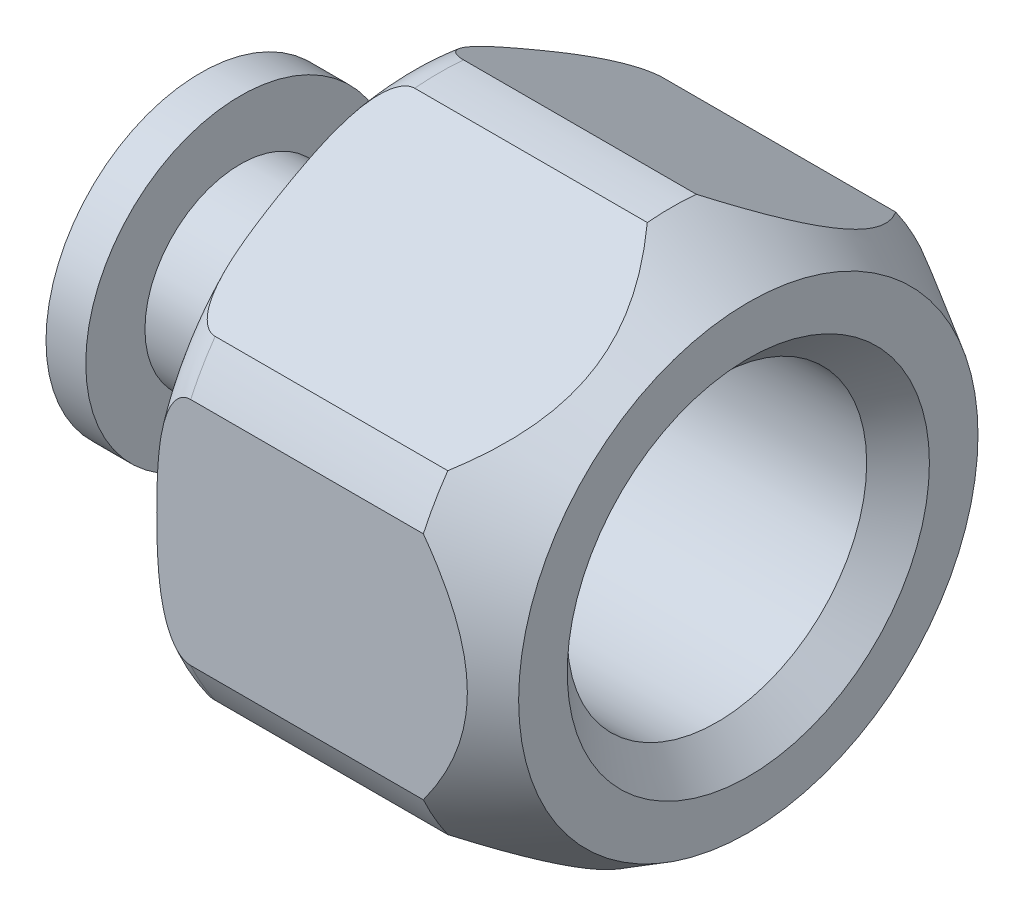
ISO-10303-21;
HEADER;
FILE_DESCRIPTION(('STEP AP214'),'2;1');
FILE_NAME('part.step','',(''),(''),'','','');
FILE_SCHEMA(('AUTOMOTIVE_DESIGN { 1 0 10303 214 1 1 1 1 }'));
ENDSEC;
DATA;
#1=APPLICATION_CONTEXT('core data for automotive mechanical design processes');
#2=APPLICATION_PROTOCOL_DEFINITION('international standard','automotive_design',2000,#1);
#3=PRODUCT_CONTEXT('',#1,'mechanical');
#4=PRODUCT('Part','Part','',(#3));
#5=PRODUCT_RELATED_PRODUCT_CATEGORY('part','',(#4));
#6=PRODUCT_DEFINITION_FORMATION('','',#4);
#7=PRODUCT_DEFINITION_CONTEXT('part definition',#1,'design');
#8=PRODUCT_DEFINITION('design','',#6,#7);
#9=PRODUCT_DEFINITION_SHAPE('','',#8);
#10=(LENGTH_UNIT() NAMED_UNIT(*) SI_UNIT(.MILLI.,.METRE.));
#11=(NAMED_UNIT(*) PLANE_ANGLE_UNIT() SI_UNIT($,.RADIAN.));
#12=(NAMED_UNIT(*) SI_UNIT($,.STERADIAN.) SOLID_ANGLE_UNIT());
#13=UNCERTAINTY_MEASURE_WITH_UNIT(LENGTH_MEASURE(1.E-05),#10,'distance_accuracy_value','');
#14=(GEOMETRIC_REPRESENTATION_CONTEXT(3) GLOBAL_UNCERTAINTY_ASSIGNED_CONTEXT((#13)) GLOBAL_UNIT_ASSIGNED_CONTEXT((#10,
#11,#12)) REPRESENTATION_CONTEXT('',''));
#15=CARTESIAN_POINT('',(0.,0.,0.));
#16=DIRECTION('',(0.,0.,1.));
#17=DIRECTION('',(1.,0.,0.));
#18=AXIS2_PLACEMENT_3D('',#15,#16,#17);
#19=CARTESIAN_POINT('',(15.748,6.604,0.));
#20=DIRECTION('',(-1.,0.,0.));
#21=DIRECTION('',(0.,0.,1.));
#22=AXIS2_PLACEMENT_3D('',#19,#20,#21);
#23=PLANE('',#22);
#24=CARTESIAN_POINT('',(15.748,0.,0.));
#25=DIRECTION('',(1.,0.,0.));
#26=DIRECTION('',(0.,0.,-1.));
#27=AXIS2_PLACEMENT_3D('',#24,#25,#26);
#28=CIRCLE('',#27,5.207);
#29=CARTESIAN_POINT('',(15.748,0.,-5.207));
#30=VERTEX_POINT('',#29);
#31=EDGE_CURVE('E360',#30,#30,#28,.T.);
#32=ORIENTED_EDGE('',*,*,#31,.F.);
#33=EDGE_LOOP('',(#32));
#34=FACE_BOUND('',#33,.T.);
#35=CARTESIAN_POINT('',(15.748,0.,0.));
#36=DIRECTION('',(-1.,0.,0.));
#37=DIRECTION('',(0.,0.,1.));
#38=AXIS2_PLACEMENT_3D('',#35,#36,#37);
#39=CIRCLE('',#38,6.604);
#40=CARTESIAN_POINT('',(15.748,0.,6.604));
#41=VERTEX_POINT('',#40);
#42=EDGE_CURVE('E249',#41,#41,#39,.T.);
#43=ORIENTED_EDGE('',*,*,#42,.F.);
#44=EDGE_LOOP('',(#43));
#45=FACE_BOUND('',#44,.T.);
#46=ADVANCED_FACE('F16',(#34,#45),#23,.F.);
#47=CARTESIAN_POINT('',(0.,0.,0.));
#48=DIRECTION('',(-1.,0.,0.));
#49=DIRECTION('',(0.,0.,1.));
#50=AXIS2_PLACEMENT_3D('',#47,#48,#49);
#51=CYLINDRICAL_SURFACE('',#50,7.874);
#52=CARTESIAN_POINT('',(13.5482954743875,0.,0.));
#53=DIRECTION('',(-1.,0.,0.));
#54=DIRECTION('',(0.,0.,1.));
#55=AXIS2_PLACEMENT_3D('',#52,#53,#54);
#56=CIRCLE('',#55,7.874);
#57=CARTESIAN_POINT('',(13.5482954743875,-3.31160262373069,-7.14375));
#58=VERTEX_POINT('',#57);
#59=CARTESIAN_POINT('',(13.5482954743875,-4.53086766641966,-6.43980699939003));
#60=VERTEX_POINT('',#59);
#61=EDGE_CURVE('E152',#58,#60,#56,.T.);
#62=ORIENTED_EDGE('',*,*,#61,.T.);
#63=DIRECTION('',(-1.,0.,0.));
#64=VECTOR('',#63,1.);
#65=CARTESIAN_POINT('',(0.,-4.53086766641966,-6.43980699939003));
#66=LINE('',#65,#64);
#67=CARTESIAN_POINT('',(6.85800000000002,-4.53086766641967,-6.43980699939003));
#68=VERTEX_POINT('',#67);
#69=EDGE_CURVE('E140',#60,#68,#66,.T.);
#70=ORIENTED_EDGE('',*,*,#69,.T.);
#71=CARTESIAN_POINT('',(6.858,0.,0.));
#72=DIRECTION('',(-1.,0.,0.));
#73=DIRECTION('',(0.,0.,1.));
#74=AXIS2_PLACEMENT_3D('',#71,#72,#73);
#75=CIRCLE('',#74,7.874);
#76=CARTESIAN_POINT('',(6.858,-3.31160262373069,-7.14375));
#77=VERTEX_POINT('',#76);
#78=EDGE_CURVE('E150',#77,#68,#75,.T.);
#79=ORIENTED_EDGE('',*,*,#78,.F.);
#80=DIRECTION('',(-1.,0.,0.));
#81=VECTOR('',#80,1.);
#82=CARTESIAN_POINT('',(0.,-3.31160262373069,-7.14375));
#83=LINE('',#82,#81);
#84=EDGE_CURVE('E415',#77,#58,#83,.F.);
#85=ORIENTED_EDGE('',*,*,#84,.T.);
#86=EDGE_LOOP('',(#62,#70,#79,#85));
#87=FACE_BOUND('',#86,.T.);
#88=ADVANCED_FACE('F148',(#87),#51,.T.);
#89=CARTESIAN_POINT('',(6.858,-7.84247029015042,-0.703943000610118));
#90=VERTEX_POINT('',#89);
#91=CARTESIAN_POINT('',(6.85800000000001,-7.84247029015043,0.703943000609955));
#92=VERTEX_POINT('',#91);
#93=EDGE_CURVE('E162',#90,#92,#75,.T.);
#94=ORIENTED_EDGE('',*,*,#93,.F.);
#95=DIRECTION('',(-1.,0.,0.));
#96=VECTOR('',#95,1.);
#97=CARTESIAN_POINT('',(0.,-7.84247029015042,-0.703943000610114));
#98=LINE('',#97,#96);
#99=CARTESIAN_POINT('',(13.5482954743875,-7.84247029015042,-0.703943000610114));
#100=VERTEX_POINT('',#99);
#101=EDGE_CURVE('E42',#90,#100,#98,.F.);
#102=ORIENTED_EDGE('',*,*,#101,.T.);
#103=CARTESIAN_POINT('',(13.5482954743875,-7.84247029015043,0.703943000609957));
#104=VERTEX_POINT('',#103);
#105=EDGE_CURVE('E369',#100,#104,#56,.T.);
#106=ORIENTED_EDGE('',*,*,#105,.T.);
#107=DIRECTION('',(-1.,0.,0.));
#108=VECTOR('',#107,1.);
#109=CARTESIAN_POINT('',(0.,-7.84247029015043,0.703943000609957));
#110=LINE('',#109,#108);
#111=EDGE_CURVE('E303',#104,#92,#110,.T.);
#112=ORIENTED_EDGE('',*,*,#111,.T.);
#113=EDGE_LOOP('',(#94,#102,#106,#112));
#114=FACE_BOUND('',#113,.T.);
#115=ADVANCED_FACE('F356',(#114),#51,.T.);
#116=CARTESIAN_POINT('',(6.858,-4.5308676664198,6.43980699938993));
#117=VERTEX_POINT('',#116);
#118=CARTESIAN_POINT('',(6.858,-3.31160262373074,7.14374999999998));
#119=VERTEX_POINT('',#118);
#120=EDGE_CURVE('E174',#117,#119,#75,.T.);
#121=ORIENTED_EDGE('',*,*,#120,.F.);
#122=DIRECTION('',(-1.,0.,0.));
#123=VECTOR('',#122,1.);
#124=CARTESIAN_POINT('',(0.,-4.5308676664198,6.43980699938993));
#125=LINE('',#124,#123);
#126=CARTESIAN_POINT('',(13.5482954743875,-4.5308676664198,6.43980699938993));
#127=VERTEX_POINT('',#126);
#128=EDGE_CURVE('E51',#117,#127,#125,.F.);
#129=ORIENTED_EDGE('',*,*,#128,.T.);
#130=CARTESIAN_POINT('',(13.5482954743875,-3.31160262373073,7.14374999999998));
#131=VERTEX_POINT('',#130);
#132=EDGE_CURVE('E374',#127,#131,#56,.T.);
#133=ORIENTED_EDGE('',*,*,#132,.T.);
#134=DIRECTION('',(-1.,0.,0.));
#135=VECTOR('',#134,1.);
#136=CARTESIAN_POINT('',(0.,-3.31160262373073,7.14374999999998));
#137=LINE('',#136,#135);
#138=EDGE_CURVE('E308',#131,#119,#137,.T.);
#139=ORIENTED_EDGE('',*,*,#138,.T.);
#140=EDGE_LOOP('',(#121,#129,#133,#139));
#141=FACE_BOUND('',#140,.T.);
#142=ADVANCED_FACE('F569',(#141),#51,.T.);
#143=CARTESIAN_POINT('',(6.858,3.31160262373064,7.14375000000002));
#144=VERTEX_POINT('',#143);
#145=CARTESIAN_POINT('',(6.85800000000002,4.53086766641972,6.43980699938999));
#146=VERTEX_POINT('',#145);
#147=EDGE_CURVE('E186',#144,#146,#75,.T.);
#148=ORIENTED_EDGE('',*,*,#147,.F.);
#149=DIRECTION('',(-1.,0.,0.));
#150=VECTOR('',#149,1.);
#151=CARTESIAN_POINT('',(0.,3.31160262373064,7.14375000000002));
#152=LINE('',#151,#150);
#153=CARTESIAN_POINT('',(13.5482954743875,3.31160262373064,7.14375000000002));
#154=VERTEX_POINT('',#153);
#155=EDGE_CURVE('E302',#144,#154,#152,.F.);
#156=ORIENTED_EDGE('',*,*,#155,.T.);
#157=CARTESIAN_POINT('',(13.5482954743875,4.53086766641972,6.43980699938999));
#158=VERTEX_POINT('',#157);
#159=EDGE_CURVE('E384',#154,#158,#56,.T.);
#160=ORIENTED_EDGE('',*,*,#159,.T.);
#161=DIRECTION('',(-1.,0.,0.));
#162=VECTOR('',#161,1.);
#163=CARTESIAN_POINT('',(0.,4.53086766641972,6.43980699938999));
#164=LINE('',#163,#162);
#165=EDGE_CURVE('E323',#158,#146,#164,.T.);
#166=ORIENTED_EDGE('',*,*,#165,.T.);
#167=EDGE_LOOP('',(#148,#156,#160,#166));
#168=FACE_BOUND('',#167,.T.);
#169=ADVANCED_FACE('F577',(#168),#51,.T.);
#170=CARTESIAN_POINT('',(6.858,7.84247029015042,0.703943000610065));
#171=VERTEX_POINT('',#170);
#172=CARTESIAN_POINT('',(6.85800000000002,7.84247029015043,-0.703943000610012));
#173=VERTEX_POINT('',#172);
#174=EDGE_CURVE('E177',#171,#173,#75,.T.);
#175=ORIENTED_EDGE('',*,*,#174,.F.);
#176=DIRECTION('',(-1.,0.,0.));
#177=VECTOR('',#176,1.);
#178=CARTESIAN_POINT('',(0.,7.84247029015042,0.70394300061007));
#179=LINE('',#178,#177);
#180=CARTESIAN_POINT('',(13.5482954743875,7.84247029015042,0.70394300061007));
#181=VERTEX_POINT('',#180);
#182=EDGE_CURVE('E320',#171,#181,#179,.F.);
#183=ORIENTED_EDGE('',*,*,#182,.T.);
#184=CARTESIAN_POINT('',(13.5482954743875,7.84247029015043,-0.703943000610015));
#185=VERTEX_POINT('',#184);
#186=EDGE_CURVE('E171',#181,#185,#56,.T.);
#187=ORIENTED_EDGE('',*,*,#186,.T.);
#188=DIRECTION('',(-1.,0.,0.));
#189=VECTOR('',#188,1.);
#190=CARTESIAN_POINT('',(0.,7.84247029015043,-0.703943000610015));
#191=LINE('',#190,#189);
#192=EDGE_CURVE('E406',#185,#173,#191,.T.);
#193=ORIENTED_EDGE('',*,*,#192,.T.);
#194=EDGE_LOOP('',(#175,#183,#187,#193));
#195=FACE_BOUND('',#194,.T.);
#196=ADVANCED_FACE('F405',(#195),#51,.T.);
#197=CARTESIAN_POINT('',(15.748,0.,0.));
#198=DIRECTION('',(-1.,0.,0.));
#199=DIRECTION('',(0.,0.,1.));
#200=AXIS2_PLACEMENT_3D('',#197,#198,#199);
#201=CONICAL_SURFACE('',#200,6.604,0.523598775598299);
#202=ORIENTED_EDGE('',*,*,#105,.F.);
#203=CARTESIAN_POINT('',(13.5480954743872,-7.8426075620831,-0.703705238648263));
#204=CARTESIAN_POINT('',(13.6542867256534,-7.76967395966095,-0.83002994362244));
#205=CARTESIAN_POINT('',(13.7568825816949,-7.69534092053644,-0.958778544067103));
#206=CARTESIAN_POINT('',(13.9529565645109,-7.54334014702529,-1.22205160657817));
#207=CARTESIAN_POINT('',(14.0463985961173,-7.46566082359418,-1.35659614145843));
#208=CARTESIAN_POINT('',(14.22296912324,-7.30555568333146,-1.63390637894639));
#209=CARTESIAN_POINT('',(14.3058820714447,-7.22306965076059,-1.77677637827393));
#210=CARTESIAN_POINT('',(14.4561004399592,-7.05470419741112,-2.06839389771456));
#211=CARTESIAN_POINT('',(14.5234295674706,-6.96883016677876,-2.21713208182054));
#212=CARTESIAN_POINT('',(14.6198619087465,-6.82302518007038,-2.46967372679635));
#213=CARTESIAN_POINT('',(14.6542315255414,-6.76396233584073,-2.57197357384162));
#214=CARTESIAN_POINT('',(14.713509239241,-6.6446442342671,-2.77863858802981));
#215=CARTESIAN_POINT('',(14.7384169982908,-6.58438893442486,-2.88300382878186));
#216=CARTESIAN_POINT('',(14.7777384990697,-6.4635555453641,-3.09229339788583));
#217=CARTESIAN_POINT('',(14.7922409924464,-6.40298473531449,-3.19720511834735));
#218=CARTESIAN_POINT('',(14.810557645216,-6.28143917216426,-3.40772820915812));
#219=CARTESIAN_POINT('',(14.8143723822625,-6.22046444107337,-3.51333954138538));
#220=CARTESIAN_POINT('',(14.8111617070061,-6.09849020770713,-3.72460511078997));
#221=CARTESIAN_POINT('',(14.8041190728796,-6.03749081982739,-3.83025914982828));
#222=CARTESIAN_POINT('',(14.7794372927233,-5.91603259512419,-4.04063096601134));
#223=CARTESIAN_POINT('',(14.7617975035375,-5.85557379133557,-4.14534868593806));
#224=CARTESIAN_POINT('',(14.7163707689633,-5.73508446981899,-4.35404231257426));
#225=CARTESIAN_POINT('',(14.688497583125,-5.67506214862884,-4.45800402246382));
#226=CARTESIAN_POINT('',(14.6235532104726,-5.55629102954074,-4.66372163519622));
#227=CARTESIAN_POINT('',(14.5864822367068,-5.49754220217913,-4.76547758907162));
#228=CARTESIAN_POINT('',(14.4868666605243,-5.35709210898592,-5.00874428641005));
#229=CARTESIAN_POINT('',(14.4201652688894,-5.27612719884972,-5.14897962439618));
#230=CARTESIAN_POINT('',(14.2731977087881,-5.11726876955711,-5.42413049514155));
#231=CARTESIAN_POINT('',(14.1929151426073,-5.03937910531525,-5.55903935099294));
#232=CARTESIAN_POINT('',(14.0230283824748,-4.88804670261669,-5.82115476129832));
#233=CARTESIAN_POINT('',(13.9336164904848,-4.81454935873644,-5.94845589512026));
#234=CARTESIAN_POINT('',(13.7465707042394,-4.67053081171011,-6.19790333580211));
#235=CARTESIAN_POINT('',(13.6489631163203,-4.6000011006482,-6.32006437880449));
#236=CARTESIAN_POINT('',(13.5480954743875,-4.5307303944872,-6.4400447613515));
#237=B_SPLINE_CURVE_WITH_KNOTS('',3,(#203,#204,#205,#206,#207,#208,#209,#210,#211,#212,#213,
#214,#215,#216,#217,#218,#219,#220,#221,#222,#223,#224,#225,#226,#227,#228,#229,#230,#231,#232,
#233,#234,#235,#236),.UNSPECIFIED.,.F.,.F.,(4,2,2,2,2,2,2,2,2,2,2,2,2,2,2,2,4),(0.,
0.541444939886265,1.08494552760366,1.63821435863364,2.19063590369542,2.5593724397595,
2.92812214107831,3.29368794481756,3.65923399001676,4.02536045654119,4.39150914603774,
4.76081711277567,5.1301165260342,5.65470457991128,6.1799305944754,6.69576705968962,
7.21000684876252),.UNSPECIFIED.);
#238=EDGE_CURVE('E154',#100,#60,#237,.T.);
#239=ORIENTED_EDGE('',*,*,#238,.T.);
#240=ORIENTED_EDGE('',*,*,#61,.F.);
#241=CARTESIAN_POINT('',(6.0170282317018,-9.91708120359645,-7.14375));
#242=CARTESIAN_POINT('',(6.25878492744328,-9.74504144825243,-7.14375));
#243=CARTESIAN_POINT('',(6.49983949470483,-9.57200727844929,-7.14375));
#244=CARTESIAN_POINT('',(6.9802737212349,-9.22359731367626,-7.14375));
#245=CARTESIAN_POINT('',(7.21965326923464,-9.04822136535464,-7.14375));
#246=CARTESIAN_POINT('',(7.69702153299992,-8.69436275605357,-7.14375));
#247=CARTESIAN_POINT('',(7.93500537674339,-8.51587351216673,-7.14375));
#248=CARTESIAN_POINT('',(8.40859632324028,-8.1557752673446,-7.14375));
#249=CARTESIAN_POINT('',(8.64420347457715,-7.97416633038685,-7.14375));
#250=CARTESIAN_POINT('',(9.13048031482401,-7.59325390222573,-7.14375));
#251=CARTESIAN_POINT('',(9.38092292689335,-7.39365985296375,-7.14375));
#252=CARTESIAN_POINT('',(9.87768349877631,-6.98940362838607,-7.14375));
#253=CARTESIAN_POINT('',(10.1240015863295,-6.78474161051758,-7.14375));
#254=CARTESIAN_POINT('',(10.6111400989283,-6.36950531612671,-7.14375));
#255=CARTESIAN_POINT('',(10.8519663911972,-6.15893794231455,-7.14375));
#256=CARTESIAN_POINT('',(11.3268521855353,-5.73031003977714,-7.14375));
#257=CARTESIAN_POINT('',(11.5609125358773,-5.5122504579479,-7.14375));
#258=CARTESIAN_POINT('',(11.9215215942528,-5.16236879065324,-7.14375));
#259=CARTESIAN_POINT('',(12.0511148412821,-5.03368407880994,-7.14375));
#260=CARTESIAN_POINT('',(12.306769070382,-4.77285875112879,-7.14375));
#261=CARTESIAN_POINT('',(12.4328302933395,-4.64071837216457,-7.14375));
#262=CARTESIAN_POINT('',(12.680905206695,-4.37227821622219,-7.14375));
#263=CARTESIAN_POINT('',(12.8029119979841,-4.23597203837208,-7.14375));
#264=CARTESIAN_POINT('',(13.0417121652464,-3.95886572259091,-7.14375));
#265=CARTESIAN_POINT('',(13.1585057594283,-3.8180657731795,-7.14375));
#266=CARTESIAN_POINT('',(13.3834021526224,-3.53420549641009,-7.14375));
#267=CARTESIAN_POINT('',(13.4916323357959,-3.39124725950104,-7.14375));
#268=CARTESIAN_POINT('',(13.7004011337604,-3.0998494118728,-7.14375));
#269=CARTESIAN_POINT('',(13.8009381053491,-2.95140864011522,-7.14375));
#270=CARTESIAN_POINT('',(14.0876948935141,-2.49771994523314,-7.14375));
#271=CARTESIAN_POINT('',(14.2599849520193,-2.18298526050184,-7.14375));
#272=CARTESIAN_POINT('',(14.4534506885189,-1.7386144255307,-7.14375));
#273=CARTESIAN_POINT('',(14.5005524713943,-1.62010938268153,-7.14375));
#274=CARTESIAN_POINT('',(14.5860353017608,-1.37994540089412,-7.14375));
#275=CARTESIAN_POINT('',(14.6244159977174,-1.25828633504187,-7.14375));
#276=CARTESIAN_POINT('',(14.6912508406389,-1.01241998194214,-7.14375));
#277=CARTESIAN_POINT('',(14.7197177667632,-0.888216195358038,-7.14375));
#278=CARTESIAN_POINT('',(14.7657774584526,-0.637812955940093,-7.14375));
#279=CARTESIAN_POINT('',(14.7833724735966,-0.51161392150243,-7.14375));
#280=CARTESIAN_POINT('',(14.8070774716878,-0.257195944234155,-7.14375));
#281=CARTESIAN_POINT('',(14.8131023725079,-0.128968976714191,-7.14375));
#282=CARTESIAN_POINT('',(14.813148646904,0.127483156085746,-7.14375));
#283=CARTESIAN_POINT('',(14.8071703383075,0.25570832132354,-7.14375));
#284=CARTESIAN_POINT('',(14.78346231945,0.511135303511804,-7.14375));
#285=CARTESIAN_POINT('',(14.7657254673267,0.638336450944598,-7.14375));
#286=CARTESIAN_POINT('',(14.7192166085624,0.890696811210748,-7.14375));
#287=CARTESIAN_POINT('',(14.6904429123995,1.01585570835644,-7.14375));
#288=CARTESIAN_POINT('',(14.6139291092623,1.2962591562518,-7.14375));
#289=CARTESIAN_POINT('',(14.5631830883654,1.45068274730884,-7.14375));
#290=CARTESIAN_POINT('',(14.4480671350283,1.75434890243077,-7.14375));
#291=CARTESIAN_POINT('',(14.3836917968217,1.90358938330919,-7.14375));
#292=CARTESIAN_POINT('',(14.243007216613,2.19804834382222,-7.14375));
#293=CARTESIAN_POINT('',(14.1665892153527,2.34321437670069,-7.14375));
#294=CARTESIAN_POINT('',(14.004416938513,2.62812651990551,-7.14375));
#295=CARTESIAN_POINT('',(13.9186652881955,2.76787413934,-7.14375));
#296=CARTESIAN_POINT('',(13.7038396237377,3.09713246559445,-7.14375));
#297=CARTESIAN_POINT('',(13.5711271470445,3.28426197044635,-7.14375));
#298=CARTESIAN_POINT('',(13.2944667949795,3.65008267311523,-7.14375));
#299=CARTESIAN_POINT('',(13.1505123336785,3.828768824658,-7.14375));
#300=CARTESIAN_POINT('',(12.8535273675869,4.17947281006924,-7.14375));
#301=CARTESIAN_POINT('',(12.7004665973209,4.35146485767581,-7.14375));
#302=CARTESIAN_POINT('',(12.3876893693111,4.68918131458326,-7.14375));
#303=CARTESIAN_POINT('',(12.2279743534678,4.85490706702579,-7.14375));
#304=CARTESIAN_POINT('',(11.9123629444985,5.17191841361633,-7.14375));
#305=CARTESIAN_POINT('',(11.7567550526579,5.32349250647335,-7.14375));
#306=CARTESIAN_POINT('',(11.4416850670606,5.62259762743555,-7.14375));
#307=CARTESIAN_POINT('',(11.2822226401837,5.770128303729,-7.14375));
#308=CARTESIAN_POINT('',(10.9615062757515,6.06044517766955,-7.14375));
#309=CARTESIAN_POINT('',(10.8002791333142,6.20326106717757,-7.14375));
#310=CARTESIAN_POINT('',(10.4752457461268,6.4858426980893,-7.14375));
#311=CARTESIAN_POINT('',(10.3114401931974,6.62560923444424,-7.14375));
#312=CARTESIAN_POINT('',(10.1465673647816,6.76408577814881,-7.14375));
#313=B_SPLINE_CURVE_WITH_KNOTS('',3,(#241,#242,#243,#244,#245,#246,#247,#248,#249,#250,#251,
#252,#253,#254,#255,#256,#257,#258,#259,#260,#261,#262,#263,#264,#265,#266,#267,#268,#269,#270,
#271,#272,#273,#274,#275,#276,#277,#278,#279,#280,#281,#282,#283,#284,#285,#286,#287,#288,#289,
#290,#291,#292,#293,#294,#295,#296,#297,#298,#299,#300,#301,#302,#303,#304,#305,#306,#307,#308,
#309,#310,#311,#312),.UNSPECIFIED.,.F.,.F.,(4,2,2,2,2,2,2,2,2,2,2,2,2,2,2,2,2,2,2,2,2,2,2,2,2,2,
2,2,2,2,2,2,2,2,2,4),(0.,0.890170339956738,1.78039926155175,2.67281882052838,3.56522009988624,
4.52591256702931,5.48657522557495,6.44615828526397,7.40562051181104,7.95346054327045,
8.50126312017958,9.04995452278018,9.59862293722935,10.1362789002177,10.6740493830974,
11.7452519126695,12.1275604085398,12.5098843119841,12.8917135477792,13.2734637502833,
13.6580106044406,14.042547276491,14.4273177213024,14.8121470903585,15.2990026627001,
15.7860516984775,16.2777821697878,16.7693746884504,17.4570227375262,18.1450767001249,
18.8355612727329,19.5258969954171,20.1775014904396,20.829162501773,21.4752777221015,
22.1212224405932),.UNSPECIFIED.);
#314=CARTESIAN_POINT('',(13.5482954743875,3.31160262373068,-7.14375));
#315=VERTEX_POINT('',#314);
#316=EDGE_CURVE('E215',#58,#315,#313,.T.);
#317=ORIENTED_EDGE('',*,*,#316,.T.);
#318=CARTESIAN_POINT('',(13.5482954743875,4.53086766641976,-6.43980699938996));
#319=VERTEX_POINT('',#318);
#320=EDGE_CURVE('E161',#319,#315,#56,.T.);
#321=ORIENTED_EDGE('',*,*,#320,.F.);
#322=CARTESIAN_POINT('',(13.5480954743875,4.5307303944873,-6.44004476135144));
#323=CARTESIAN_POINT('',(13.6542867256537,4.60366399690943,-6.31372005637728));
#324=CARTESIAN_POINT('',(13.7568825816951,4.67799703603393,-6.18497145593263));
#325=CARTESIAN_POINT('',(13.9529565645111,4.82999780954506,-5.92169839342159));
#326=CARTESIAN_POINT('',(14.0463985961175,4.90767713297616,-5.78715385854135));
#327=CARTESIAN_POINT('',(14.2229691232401,5.06778227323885,-5.50984362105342));
#328=CARTESIAN_POINT('',(14.3058820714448,5.15026830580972,-5.3669736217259));
#329=CARTESIAN_POINT('',(14.4561004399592,5.31863375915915,-5.07535610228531));
#330=CARTESIAN_POINT('',(14.5234295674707,5.4045077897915,-4.92661791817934));
#331=CARTESIAN_POINT('',(14.6198619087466,5.55031277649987,-4.67407627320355));
#332=CARTESIAN_POINT('',(14.6542315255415,5.60937562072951,-4.57177642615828));
#333=CARTESIAN_POINT('',(14.7135092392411,5.72869372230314,-4.36511141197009));
#334=CARTESIAN_POINT('',(14.7384169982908,5.78894902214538,-4.26074617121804));
#335=CARTESIAN_POINT('',(14.7777384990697,5.90978241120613,-4.05145660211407));
#336=CARTESIAN_POINT('',(14.7922409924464,5.97035322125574,-3.94654488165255));
#337=CARTESIAN_POINT('',(14.810557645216,6.09189878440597,-3.73602179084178));
#338=CARTESIAN_POINT('',(14.8143723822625,6.15287351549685,-3.63041045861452));
#339=CARTESIAN_POINT('',(14.8111617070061,6.27484774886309,-3.41914488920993));
#340=CARTESIAN_POINT('',(14.8041190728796,6.33584713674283,-3.31349085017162));
#341=CARTESIAN_POINT('',(14.7794372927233,6.45730536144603,-3.10311903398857));
#342=CARTESIAN_POINT('',(14.7617975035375,6.51776416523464,-2.99840131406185));
#343=CARTESIAN_POINT('',(14.7163707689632,6.63825348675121,-2.78970768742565));
#344=CARTESIAN_POINT('',(14.6884975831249,6.69827580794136,-2.68574597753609));
#345=CARTESIAN_POINT('',(14.6235532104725,6.81704692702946,-2.4800283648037));
#346=CARTESIAN_POINT('',(14.5864822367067,6.87579575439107,-2.37827241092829));
#347=CARTESIAN_POINT('',(14.4868666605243,7.01624584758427,-2.13500571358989));
#348=CARTESIAN_POINT('',(14.4201652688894,7.09721075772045,-1.99477037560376));
#349=CARTESIAN_POINT('',(14.273197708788,7.25606918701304,-1.71961950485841));
#350=CARTESIAN_POINT('',(14.1929151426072,7.33395885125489,-1.58471064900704));
#351=CARTESIAN_POINT('',(14.0230283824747,7.48529125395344,-1.32259523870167));
#352=CARTESIAN_POINT('',(13.9336164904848,7.55878859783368,-1.19529410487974));
#353=CARTESIAN_POINT('',(13.7465707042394,7.70280714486,-0.945846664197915));
#354=CARTESIAN_POINT('',(13.6489631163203,7.7733368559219,-0.823685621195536));
#355=CARTESIAN_POINT('',(13.5480954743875,7.84260756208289,-0.703705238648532));
#356=B_SPLINE_CURVE_WITH_KNOTS('',3,(#322,#323,#324,#325,#326,#327,#328,#329,#330,#331,#332,
#333,#334,#335,#336,#337,#338,#339,#340,#341,#342,#343,#344,#345,#346,#347,#348,#349,#350,#351,
#352,#353,#354,#355),.UNSPECIFIED.,.F.,.F.,(4,2,2,2,2,2,2,2,2,2,2,2,2,2,2,2,4),(0.,
0.541444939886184,1.0849455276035,1.63821435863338,2.19063590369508,2.55937243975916,
2.92812214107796,3.2936879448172,3.6592339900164,4.02536045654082,4.39150914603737,
4.7608171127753,5.13011652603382,5.65470457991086,6.17993059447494,6.69576705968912,
7.21000684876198),.UNSPECIFIED.);
#357=EDGE_CURVE('E410',#319,#185,#356,.T.);
#358=ORIENTED_EDGE('',*,*,#357,.T.);
#359=ORIENTED_EDGE('',*,*,#186,.F.);
#360=CARTESIAN_POINT('',(13.5480954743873,7.84260756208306,0.703705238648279));
#361=CARTESIAN_POINT('',(13.6542867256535,7.76967395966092,0.830029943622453));
#362=CARTESIAN_POINT('',(13.7568825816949,7.69534092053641,0.958778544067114));
#363=CARTESIAN_POINT('',(13.9529565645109,7.54334014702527,1.22205160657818));
#364=CARTESIAN_POINT('',(14.0463985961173,7.46566082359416,1.35659614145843));
#365=CARTESIAN_POINT('',(14.22296912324,7.30555568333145,1.63390637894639));
#366=CARTESIAN_POINT('',(14.3058820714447,7.22306965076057,1.77677637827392));
#367=CARTESIAN_POINT('',(14.4561004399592,7.05470419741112,2.06839389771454));
#368=CARTESIAN_POINT('',(14.5234295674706,6.96883016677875,2.21713208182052));
#369=CARTESIAN_POINT('',(14.6198619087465,6.82302518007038,2.46967372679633));
#370=CARTESIAN_POINT('',(14.6542315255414,6.76396233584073,2.57197357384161));
#371=CARTESIAN_POINT('',(14.713509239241,6.6446442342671,2.77863858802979));
#372=CARTESIAN_POINT('',(14.7384169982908,6.58438893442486,2.88300382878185));
#373=CARTESIAN_POINT('',(14.7777384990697,6.46355554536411,3.09229339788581));
#374=CARTESIAN_POINT('',(14.7922409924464,6.4029847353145,3.19720511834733));
#375=CARTESIAN_POINT('',(14.810557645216,6.28143917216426,3.40772820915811));
#376=CARTESIAN_POINT('',(14.8143723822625,6.22046444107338,3.51333954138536));
#377=CARTESIAN_POINT('',(14.8111617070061,6.09849020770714,3.72460511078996));
#378=CARTESIAN_POINT('',(14.8041190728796,6.0374908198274,3.83025914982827));
#379=CARTESIAN_POINT('',(14.7794372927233,5.9160325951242,4.04063096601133));
#380=CARTESIAN_POINT('',(14.7617975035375,5.85557379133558,4.14534868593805));
#381=CARTESIAN_POINT('',(14.7163707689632,5.73508446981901,4.35404231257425));
#382=CARTESIAN_POINT('',(14.688497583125,5.67506214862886,4.4580040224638));
#383=CARTESIAN_POINT('',(14.6235532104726,5.55629102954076,4.66372163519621));
#384=CARTESIAN_POINT('',(14.5864822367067,5.49754220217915,4.76547758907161));
#385=CARTESIAN_POINT('',(14.4868666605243,5.35709210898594,5.00874428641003));
#386=CARTESIAN_POINT('',(14.4201652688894,5.27612719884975,5.14897962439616));
#387=CARTESIAN_POINT('',(14.2731977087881,5.11726876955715,5.42413049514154));
#388=CARTESIAN_POINT('',(14.1929151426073,5.03937910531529,5.55903935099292));
#389=CARTESIAN_POINT('',(14.0230283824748,4.88804670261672,5.82115476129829));
#390=CARTESIAN_POINT('',(13.9336164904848,4.81454935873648,5.94845589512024));
#391=CARTESIAN_POINT('',(13.7465707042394,4.67053081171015,6.19790333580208));
#392=CARTESIAN_POINT('',(13.6489631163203,4.60000110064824,6.32006437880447));
#393=CARTESIAN_POINT('',(13.5480954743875,4.53073039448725,6.44004476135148));
#394=B_SPLINE_CURVE_WITH_KNOTS('',3,(#360,#361,#362,#363,#364,#365,#366,#367,#368,#369,#370,
#371,#372,#373,#374,#375,#376,#377,#378,#379,#380,#381,#382,#383,#384,#385,#386,#387,#388,#389,
#390,#391,#392,#393),.UNSPECIFIED.,.F.,.F.,(4,2,2,2,2,2,2,2,2,2,2,2,2,2,2,2,4),(0.,
0.541444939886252,1.08494552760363,1.63821435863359,2.19063590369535,2.55937243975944,
2.92812214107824,3.2936879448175,3.6592339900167,4.02536045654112,4.39150914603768,
4.7608171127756,5.13011652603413,5.6547045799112,6.17993059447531,6.69576705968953,
7.21000684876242),.UNSPECIFIED.);
#395=EDGE_CURVE('E327',#181,#158,#394,.T.);
#396=ORIENTED_EDGE('',*,*,#395,.T.);
#397=ORIENTED_EDGE('',*,*,#159,.F.);
#398=CARTESIAN_POINT('',(6.01702823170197,-9.91708120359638,7.14374999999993));
#399=CARTESIAN_POINT('',(6.25878492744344,-9.74504144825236,7.14374999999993));
#400=CARTESIAN_POINT('',(6.49983949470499,-9.57200727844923,7.14374999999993));
#401=CARTESIAN_POINT('',(6.98027372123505,-9.2235973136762,7.14374999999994));
#402=CARTESIAN_POINT('',(7.21965326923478,-9.04822136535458,7.14374999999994));
#403=CARTESIAN_POINT('',(7.69702153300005,-8.69436275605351,7.14374999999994));
#404=CARTESIAN_POINT('',(7.93500537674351,-8.51587351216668,7.14374999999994));
#405=CARTESIAN_POINT('',(8.4085963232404,-8.15577526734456,7.14374999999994));
#406=CARTESIAN_POINT('',(8.64420347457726,-7.97416633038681,7.14374999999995));
#407=CARTESIAN_POINT('',(9.13048031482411,-7.5932539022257,7.14374999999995));
#408=CARTESIAN_POINT('',(9.38092292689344,-7.39365985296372,7.14374999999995));
#409=CARTESIAN_POINT('',(9.87768349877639,-6.98940362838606,7.14374999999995));
#410=CARTESIAN_POINT('',(10.1240015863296,-6.78474161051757,7.14374999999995));
#411=CARTESIAN_POINT('',(10.6111400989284,-6.36950531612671,7.14374999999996));
#412=CARTESIAN_POINT('',(10.8519663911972,-6.15893794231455,7.14374999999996));
#413=CARTESIAN_POINT('',(11.3268521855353,-5.73031003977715,7.14374999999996));
#414=CARTESIAN_POINT('',(11.5609125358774,-5.51225045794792,7.14374999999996));
#415=CARTESIAN_POINT('',(11.9215215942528,-5.16236879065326,7.14374999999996));
#416=CARTESIAN_POINT('',(12.0511148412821,-5.03368407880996,7.14374999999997));
#417=CARTESIAN_POINT('',(12.306769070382,-4.77285875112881,7.14374999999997));
#418=CARTESIAN_POINT('',(12.4328302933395,-4.64071837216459,7.14374999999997));
#419=CARTESIAN_POINT('',(12.680905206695,-4.3722782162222,7.14374999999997));
#420=CARTESIAN_POINT('',(12.8029119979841,-4.2359720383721,7.14374999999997));
#421=CARTESIAN_POINT('',(13.0417121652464,-3.95886572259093,7.14374999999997));
#422=CARTESIAN_POINT('',(13.1585057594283,-3.81806577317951,7.14374999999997));
#423=CARTESIAN_POINT('',(13.3834021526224,-3.53420549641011,7.14374999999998));
#424=CARTESIAN_POINT('',(13.4916323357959,-3.39124725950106,7.14374999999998));
#425=CARTESIAN_POINT('',(13.7004011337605,-3.09984941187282,7.14374999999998));
#426=CARTESIAN_POINT('',(13.8009381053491,-2.95140864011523,7.14374999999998));
#427=CARTESIAN_POINT('',(14.0876948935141,-2.49771994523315,7.14374999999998));
#428=CARTESIAN_POINT('',(14.2599849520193,-2.18298526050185,7.14374999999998));
#429=CARTESIAN_POINT('',(14.4534506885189,-1.73861442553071,7.14374999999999));
#430=CARTESIAN_POINT('',(14.5005524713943,-1.62010938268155,7.14374999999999));
#431=CARTESIAN_POINT('',(14.5860353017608,-1.37994540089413,7.14374999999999));
#432=CARTESIAN_POINT('',(14.6244159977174,-1.25828633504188,7.14374999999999));
#433=CARTESIAN_POINT('',(14.6912508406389,-1.01241998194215,7.14374999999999));
#434=CARTESIAN_POINT('',(14.7197177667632,-0.888216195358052,7.14374999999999));
#435=CARTESIAN_POINT('',(14.7657774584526,-0.637812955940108,7.14375));
#436=CARTESIAN_POINT('',(14.7833724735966,-0.511613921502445,7.14375));
#437=CARTESIAN_POINT('',(14.8070774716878,-0.25719594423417,7.14375));
#438=CARTESIAN_POINT('',(14.8131023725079,-0.128968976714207,7.14375));
#439=CARTESIAN_POINT('',(14.813148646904,0.127483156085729,7.14375));
#440=CARTESIAN_POINT('',(14.8071703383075,0.255708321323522,7.14375));
#441=CARTESIAN_POINT('',(14.78346231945,0.511135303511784,7.14375));
#442=CARTESIAN_POINT('',(14.7657254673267,0.638336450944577,7.14375));
#443=CARTESIAN_POINT('',(14.7192166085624,0.890696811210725,7.14375000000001));
#444=CARTESIAN_POINT('',(14.6904429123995,1.01585570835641,7.14375000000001));
#445=CARTESIAN_POINT('',(14.6139291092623,1.29625915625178,7.14375000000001));
#446=CARTESIAN_POINT('',(14.5631830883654,1.45068274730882,7.14375000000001));
#447=CARTESIAN_POINT('',(14.4480671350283,1.75434890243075,7.14375000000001));
#448=CARTESIAN_POINT('',(14.3836917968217,1.90358938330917,7.14375000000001));
#449=CARTESIAN_POINT('',(14.2430072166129,2.19804834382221,7.14375000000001));
#450=CARTESIAN_POINT('',(14.1665892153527,2.34321437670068,7.14375000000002));
#451=CARTESIAN_POINT('',(14.004416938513,2.6281265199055,7.14375000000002));
#452=CARTESIAN_POINT('',(13.9186652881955,2.76787413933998,7.14375000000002));
#453=CARTESIAN_POINT('',(13.7038396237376,3.09713246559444,7.14375000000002));
#454=CARTESIAN_POINT('',(13.5711271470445,3.28426197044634,7.14375000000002));
#455=CARTESIAN_POINT('',(13.2944667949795,3.65008267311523,7.14375000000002));
#456=CARTESIAN_POINT('',(13.1505123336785,3.828768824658,7.14375000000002));
#457=CARTESIAN_POINT('',(12.8535273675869,4.17947281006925,7.14375000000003));
#458=CARTESIAN_POINT('',(12.7004665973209,4.35146485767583,7.14375000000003));
#459=CARTESIAN_POINT('',(12.3876893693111,4.68918131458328,7.14375000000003));
#460=CARTESIAN_POINT('',(12.2279743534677,4.85490706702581,7.14375000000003));
#461=CARTESIAN_POINT('',(11.9123629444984,5.17191841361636,7.14375000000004));
#462=CARTESIAN_POINT('',(11.7567550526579,5.32349250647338,7.14375000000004));
#463=CARTESIAN_POINT('',(11.4416850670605,5.62259762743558,7.14375000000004));
#464=CARTESIAN_POINT('',(11.2822226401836,5.77012830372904,7.14375000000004));
#465=CARTESIAN_POINT('',(10.9615062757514,6.06044517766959,7.14375000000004));
#466=CARTESIAN_POINT('',(10.8002791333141,6.20326106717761,7.14375000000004));
#467=CARTESIAN_POINT('',(10.4752457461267,6.48584269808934,7.14375000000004));
#468=CARTESIAN_POINT('',(10.3114401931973,6.62560923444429,7.14375000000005));
#469=CARTESIAN_POINT('',(10.1465673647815,6.76408577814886,7.14375000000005));
#470=B_SPLINE_CURVE_WITH_KNOTS('',3,(#398,#399,#400,#401,#402,#403,#404,#405,#406,#407,#408,
#409,#410,#411,#412,#413,#414,#415,#416,#417,#418,#419,#420,#421,#422,#423,#424,#425,#426,#427,
#428,#429,#430,#431,#432,#433,#434,#435,#436,#437,#438,#439,#440,#441,#442,#443,#444,#445,#446,
#447,#448,#449,#450,#451,#452,#453,#454,#455,#456,#457,#458,#459,#460,#461,#462,#463,#464,#465,
#466,#467,#468,#469),.UNSPECIFIED.,.F.,.F.,(4,2,2,2,2,2,2,2,2,2,2,2,2,2,2,2,2,2,2,2,2,2,2,2,2,2,
2,2,2,2,2,2,2,2,2,4),(0.,0.890170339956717,1.78039926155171,2.67281882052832,3.56522009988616,
4.5259125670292,5.48657522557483,6.44615828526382,7.40562051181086,7.95346054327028,
8.50126312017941,9.04995452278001,9.59862293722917,10.1362789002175,10.6740493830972,
11.7452519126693,12.1275604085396,12.5098843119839,12.891713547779,13.2734637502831,
13.6580106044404,14.0425472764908,14.4273177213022,14.8121470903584,15.2990026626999,
15.7860516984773,16.2777821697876,16.7693746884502,17.4570227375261,18.1450767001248,
18.8355612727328,19.525896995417,20.1775014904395,20.8291625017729,21.4752777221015,
22.1212224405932),.UNSPECIFIED.);
#471=EDGE_CURVE('E312',#154,#131,#470,.F.);
#472=ORIENTED_EDGE('',*,*,#471,.T.);
#473=ORIENTED_EDGE('',*,*,#132,.F.);
#474=CARTESIAN_POINT('',(13.5480954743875,-4.53073039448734,6.44004476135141));
#475=CARTESIAN_POINT('',(13.6542867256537,-4.60366399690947,6.31372005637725));
#476=CARTESIAN_POINT('',(13.7568825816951,-4.67799703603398,6.18497145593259));
#477=CARTESIAN_POINT('',(13.9529565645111,-4.8299978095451,5.92169839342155));
#478=CARTESIAN_POINT('',(14.0463985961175,-4.9076771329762,5.78715385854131));
#479=CARTESIAN_POINT('',(14.2229691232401,-5.06778227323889,5.50984362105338));
#480=CARTESIAN_POINT('',(14.3058820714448,-5.15026830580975,5.36697362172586));
#481=CARTESIAN_POINT('',(14.4561004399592,-5.31863375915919,5.07535610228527));
#482=CARTESIAN_POINT('',(14.5234295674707,-5.40450778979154,4.92661791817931));
#483=CARTESIAN_POINT('',(14.6198619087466,-5.5503127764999,4.67407627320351));
#484=CARTESIAN_POINT('',(14.6542315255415,-5.60937562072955,4.57177642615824));
#485=CARTESIAN_POINT('',(14.7135092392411,-5.72869372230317,4.36511141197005));
#486=CARTESIAN_POINT('',(14.7384169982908,-5.78894902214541,4.260746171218));
#487=CARTESIAN_POINT('',(14.7777384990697,-5.90978241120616,4.05145660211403));
#488=CARTESIAN_POINT('',(14.7922409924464,-5.97035322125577,3.94654488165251));
#489=CARTESIAN_POINT('',(14.810557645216,-6.091898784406,3.73602179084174));
#490=CARTESIAN_POINT('',(14.8143723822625,-6.15287351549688,3.63041045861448));
#491=CARTESIAN_POINT('',(14.8111617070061,-6.27484774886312,3.41914488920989));
#492=CARTESIAN_POINT('',(14.8041190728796,-6.33584713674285,3.31349085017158));
#493=CARTESIAN_POINT('',(14.7794372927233,-6.45730536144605,3.10311903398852));
#494=CARTESIAN_POINT('',(14.7617975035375,-6.51776416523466,2.9984013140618));
#495=CARTESIAN_POINT('',(14.7163707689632,-6.63825348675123,2.7897076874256));
#496=CARTESIAN_POINT('',(14.6884975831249,-6.69827580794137,2.68574597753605));
#497=CARTESIAN_POINT('',(14.6235532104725,-6.81704692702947,2.48002836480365));
#498=CARTESIAN_POINT('',(14.5864822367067,-6.87579575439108,2.37827241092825));
#499=CARTESIAN_POINT('',(14.4868666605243,-7.01624584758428,2.13500571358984));
#500=CARTESIAN_POINT('',(14.4201652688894,-7.09721075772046,1.99477037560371));
#501=CARTESIAN_POINT('',(14.273197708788,-7.25606918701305,1.71961950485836));
#502=CARTESIAN_POINT('',(14.1929151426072,-7.3339588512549,1.58471064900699));
#503=CARTESIAN_POINT('',(14.0230283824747,-7.48529125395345,1.32259523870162));
#504=CARTESIAN_POINT('',(13.9336164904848,-7.55878859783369,1.19529410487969));
#505=CARTESIAN_POINT('',(13.7465707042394,-7.70280714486,0.945846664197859));
#506=CARTESIAN_POINT('',(13.6489631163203,-7.77333685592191,0.823685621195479));
#507=CARTESIAN_POINT('',(13.5480954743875,-7.8426075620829,0.703705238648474));
#508=B_SPLINE_CURVE_WITH_KNOTS('',3,(#474,#475,#476,#477,#478,#479,#480,#481,#482,#483,#484,
#485,#486,#487,#488,#489,#490,#491,#492,#493,#494,#495,#496,#497,#498,#499,#500,#501,#502,#503,
#504,#505,#506,#507),.UNSPECIFIED.,.F.,.F.,(4,2,2,2,2,2,2,2,2,2,2,2,2,2,2,2,4),(0.,
0.541444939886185,1.0849455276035,1.63821435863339,2.19063590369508,2.55937243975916,
2.92812214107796,3.29368794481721,3.6592339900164,4.02536045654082,4.39150914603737,
4.76081711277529,5.13011652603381,5.65470457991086,6.17993059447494,6.69576705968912,
7.21000684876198),.UNSPECIFIED.);
#509=EDGE_CURVE('E293',#127,#104,#508,.T.);
#510=ORIENTED_EDGE('',*,*,#509,.T.);
#511=EDGE_LOOP('',(#202,#239,#240,#317,#321,#358,#359,#396,#397,#472,#473,#510));
#512=FACE_BOUND('',#511,.T.);
#513=ORIENTED_EDGE('',*,*,#42,.T.);
#514=EDGE_LOOP('',(#513));
#515=FACE_BOUND('',#514,.T.);
#516=ADVANCED_FACE('F226',(#512,#515),#201,.T.);
#517=CARTESIAN_POINT('',(6.858,4.53086766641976,-6.43980699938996));
#518=VERTEX_POINT('',#517);
#519=CARTESIAN_POINT('',(6.858,3.31160262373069,-7.14375));
#520=VERTEX_POINT('',#519);
#521=EDGE_CURVE('E164',#518,#520,#75,.T.);
#522=ORIENTED_EDGE('',*,*,#521,.F.);
#523=DIRECTION('',(-1.,0.,0.));
#524=VECTOR('',#523,1.);
#525=CARTESIAN_POINT('',(0.,4.53086766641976,-6.43980699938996));
#526=LINE('',#525,#524);
#527=EDGE_CURVE('E335',#518,#319,#526,.F.);
#528=ORIENTED_EDGE('',*,*,#527,.T.);
#529=ORIENTED_EDGE('',*,*,#320,.T.);
#530=DIRECTION('',(-1.,0.,0.));
#531=VECTOR('',#530,1.);
#532=CARTESIAN_POINT('',(0.,3.31160262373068,-7.14375));
#533=LINE('',#532,#531);
#534=EDGE_CURVE('E224',#315,#520,#533,.T.);
#535=ORIENTED_EDGE('',*,*,#534,.T.);
#536=EDGE_LOOP('',(#522,#528,#529,#535));
#537=FACE_BOUND('',#536,.T.);
#538=ADVANCED_FACE('F259',(#537),#51,.T.);
#539=CARTESIAN_POINT('',(6.858,0.,0.));
#540=DIRECTION('',(-1.,0.,0.));
#541=DIRECTION('',(0.,0.,1.));
#542=AXIS2_PLACEMENT_3D('',#539,#540,#541);
#543=TOROIDAL_SURFACE('',#542,6.858,1.016);
#544=CARTESIAN_POINT('',(5.842,0.,0.));
#545=DIRECTION('',(-1.,0.,0.));
#546=DIRECTION('',(0.,0.,1.));
#547=AXIS2_PLACEMENT_3D('',#544,#545,#546);
#548=CIRCLE('',#547,6.858);
#549=CARTESIAN_POINT('',(5.842,0.,6.858));
#550=VERTEX_POINT('',#549);
#551=EDGE_CURVE('E178',#550,#550,#548,.T.);
#552=ORIENTED_EDGE('',*,*,#551,.F.);
#553=EDGE_LOOP('',(#552));
#554=FACE_BOUND('',#553,.T.);
#555=ORIENTED_EDGE('',*,*,#78,.T.);
#556=CARTESIAN_POINT('',(6.8582,-4.53086768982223,-6.43980695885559));
#557=CARTESIAN_POINT('',(6.83210027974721,-4.53082813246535,-6.43987547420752));
#558=CARTESIAN_POINT('',(6.80607515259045,-4.53204914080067,-6.43776062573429));
#559=CARTESIAN_POINT('',(6.75507685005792,-4.53671675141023,-6.42967608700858));
#560=CARTESIAN_POINT('',(6.73009608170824,-4.54014230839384,-6.42374284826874));
#561=CARTESIAN_POINT('',(6.68165358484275,-4.54891865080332,-6.40854177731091));
#562=CARTESIAN_POINT('',(6.65818711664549,-4.55426304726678,-6.39928501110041));
#563=CARTESIAN_POINT('',(6.61291371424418,-4.56652045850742,-6.37805455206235));
#564=CARTESIAN_POINT('',(6.59111100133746,-4.57343729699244,-6.36607423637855));
#565=CARTESIAN_POINT('',(6.5340136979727,-4.59400056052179,-6.33045761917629));
#566=CARTESIAN_POINT('',(6.50049068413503,-4.60887323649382,-6.30469738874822));
#567=CARTESIAN_POINT('',(6.43832392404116,-4.64098143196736,-6.2490843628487));
#568=CARTESIAN_POINT('',(6.40969604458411,-4.65822432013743,-6.21921880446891));
#569=CARTESIAN_POINT('',(6.35876089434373,-4.6927950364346,-6.15934056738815));
#570=CARTESIAN_POINT('',(6.33613157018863,-4.7100063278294,-6.12952973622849));
#571=CARTESIAN_POINT('',(6.29387499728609,-4.74533606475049,-6.06833683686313));
#572=CARTESIAN_POINT('',(6.27425050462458,-4.76345532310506,-6.03695336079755));
#573=CARTESIAN_POINT('',(6.23755562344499,-4.800336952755,-5.97307250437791));
#574=CARTESIAN_POINT('',(6.22048689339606,-4.81909973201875,-5.94057441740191));
#575=CARTESIAN_POINT('',(6.18855194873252,-4.85707392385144,-5.87480118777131));
#576=CARTESIAN_POINT('',(6.17368481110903,-4.8762851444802,-5.84152637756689));
#577=CARTESIAN_POINT('',(6.13829616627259,-4.9255281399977,-5.75623500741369));
#578=CARTESIAN_POINT('',(6.11906643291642,-4.95579159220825,-5.70381717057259));
#579=CARTESIAN_POINT('',(6.08419180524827,-5.01683577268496,-5.59808554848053));
#580=CARTESIAN_POINT('',(6.06854891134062,-5.04761677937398,-5.54477128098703));
#581=CARTESIAN_POINT('',(6.02592099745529,-5.14057397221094,-5.38376470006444));
#582=CARTESIAN_POINT('',(6.00331270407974,-5.20324933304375,-5.2752077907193));
#583=CARTESIAN_POINT('',(5.96576920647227,-5.32985567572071,-5.05591917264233));
#584=CARTESIAN_POINT('',(5.95092496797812,-5.3937928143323,-4.9451768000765));
#585=CARTESIAN_POINT('',(5.92681626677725,-5.52181363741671,-4.72343823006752));
#586=CARTESIAN_POINT('',(5.91754267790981,-5.58589690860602,-4.61244274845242));
#587=CARTESIAN_POINT('',(5.90165338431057,-5.72437822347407,-4.37258607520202));
#588=CARTESIAN_POINT('',(5.8956960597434,-5.79879383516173,-4.24369445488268));
#589=CARTESIAN_POINT('',(5.88726345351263,-5.94768364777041,-3.98580973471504));
#590=CARTESIAN_POINT('',(5.8847888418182,-6.02215785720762,-3.85681662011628));
#591=CARTESIAN_POINT('',(5.88256502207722,-6.17141696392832,-3.59829226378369));
#592=CARTESIAN_POINT('',(5.88282688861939,-6.24620189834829,-3.46876095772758));
#593=CARTESIAN_POINT('',(5.88618301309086,-6.3957373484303,-3.20975796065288));
#594=CARTESIAN_POINT('',(5.88927648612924,-6.47048786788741,-3.080286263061));
#595=CARTESIAN_POINT('',(5.89915150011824,-6.61859324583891,-2.82376022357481));
#596=CARTESIAN_POINT('',(5.90586611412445,-6.69194916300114,-2.69670404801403));
#597=CARTESIAN_POINT('',(5.92470032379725,-6.83858219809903,-2.44272818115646));
#598=CARTESIAN_POINT('',(5.93682527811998,-6.91185916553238,-2.31580875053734));
#599=CARTESIAN_POINT('',(5.96118355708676,-7.02118778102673,-2.12644603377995));
#600=CARTESIAN_POINT('',(5.97029056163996,-7.05741190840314,-2.06370400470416));
#601=CARTESIAN_POINT('',(5.99105996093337,-7.12967439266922,-1.93854171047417));
#602=CARTESIAN_POINT('',(6.00272192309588,-7.16571277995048,-1.87612139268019));
#603=CARTESIAN_POINT('',(6.02919551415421,-7.23743627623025,-1.75189265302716));
#604=CARTESIAN_POINT('',(6.04400146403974,-7.2731219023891,-1.69008333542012));
#605=CARTESIAN_POINT('',(6.07756848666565,-7.3440191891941,-1.56728563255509));
#606=CARTESIAN_POINT('',(6.09632734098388,-7.37923110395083,-1.50629680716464));
#607=CARTESIAN_POINT('',(6.12633378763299,-7.42835579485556,-1.42121034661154));
#608=CARTESIAN_POINT('',(6.13549136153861,-7.44258927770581,-1.39655723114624));
#609=CARTESIAN_POINT('',(6.15475473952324,-7.47090040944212,-1.34752091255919));
#610=CARTESIAN_POINT('',(6.16486088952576,-7.48497799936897,-1.32313781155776));
#611=CARTESIAN_POINT('',(6.19684360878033,-7.52703058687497,-1.25030059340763));
#612=CARTESIAN_POINT('',(6.2203168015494,-7.55471134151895,-1.2023561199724));
#613=CARTESIAN_POINT('',(6.2787232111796,-7.61524421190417,-1.09751011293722));
#614=CARTESIAN_POINT('',(6.31505404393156,-7.64776579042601,-1.04118108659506));
#615=CARTESIAN_POINT('',(6.39850835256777,-7.70914701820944,-0.934865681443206));
#616=CARTESIAN_POINT('',(6.44555653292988,-7.7380301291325,-0.884838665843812));
#617=CARTESIAN_POINT('',(6.52166590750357,-7.7735466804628,-0.823322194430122));
#618=CARTESIAN_POINT('',(6.54495506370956,-7.78325104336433,-0.806513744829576));
#619=CARTESIAN_POINT('',(6.59402740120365,-7.80097702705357,-0.775811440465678));
#620=CARTESIAN_POINT('',(6.61981115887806,-7.80899825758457,-0.761918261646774));
#621=CARTESIAN_POINT('',(6.67407799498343,-7.82289420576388,-0.737849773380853));
#622=CARTESIAN_POINT('',(6.70259247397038,-7.82873888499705,-0.72772649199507));
#623=CARTESIAN_POINT('',(6.7613416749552,-7.83749947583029,-0.712552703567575));
#624=CARTESIAN_POINT('',(6.79156948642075,-7.84042637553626,-0.707483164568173));
#625=CARTESIAN_POINT('',(6.82802963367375,-7.84196633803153,-0.704815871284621));
#626=CARTESIAN_POINT('',(6.83405920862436,-7.84215643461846,-0.704486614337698));
#627=CARTESIAN_POINT('',(6.84612504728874,-7.84240884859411,-0.704049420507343));
#628=CARTESIAN_POINT('',(6.85216130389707,-7.84247125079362,-0.703941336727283));
#629=CARTESIAN_POINT('',(6.8582,-7.84247026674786,-0.703943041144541));
#630=B_SPLINE_CURVE_WITH_KNOTS('',3,(#556,#557,#558,#559,#560,#561,#562,#563,#564,#565,#566,
#567,#568,#569,#570,#571,#572,#573,#574,#575,#576,#577,#578,#579,#580,#581,#582,#583,#584,#585,
#586,#587,#588,#589,#590,#591,#592,#593,#594,#595,#596,#597,#598,#599,#600,#601,#602,#603,#604,
#605,#606,#607,#608,#609,#610,#611,#612,#613,#614,#615,#616,#617,#618,#619,#620,#621,#622,#623,
#624,#625,#626,#627,#628,#629),.UNSPECIFIED.,.F.,.F.,(4,2,2,2,2,2,2,2,2,2,2,2,2,2,2,2,2,2,2,2,2,
2,2,2,2,2,2,2,2,2,2,2,2,2,2,2,4),(0.,0.0780637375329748,0.155393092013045,0.232467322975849,
0.309731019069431,0.443405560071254,0.577505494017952,0.700906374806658,0.82441977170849,
0.948012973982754,1.07155421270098,1.2619248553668,1.45240141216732,1.83407783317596,
2.22013119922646,2.60555037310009,3.0523426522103,3.49922086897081,3.94790831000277,
4.39647141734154,4.83701476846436,5.27799542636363,5.49701639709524,5.7160003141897,
5.93459199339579,6.15306132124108,6.24275774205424,6.33248700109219,6.51265776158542,
6.73555956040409,6.95694117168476,7.04766700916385,7.13841385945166,7.23037036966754,
7.32197925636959,7.3401010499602,7.35821080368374),.UNSPECIFIED.);
#631=EDGE_CURVE('E10',#68,#90,#630,.T.);
#632=ORIENTED_EDGE('',*,*,#631,.T.);
#633=ORIENTED_EDGE('',*,*,#93,.T.);
#634=CARTESIAN_POINT('',(6.8582,-7.84247026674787,0.70394304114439));
#635=CARTESIAN_POINT('',(6.83210027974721,-7.84250982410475,0.703874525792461));
#636=CARTESIAN_POINT('',(6.80607515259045,-7.84128881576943,0.705989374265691));
#637=CARTESIAN_POINT('',(6.75507685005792,-7.83662120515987,0.7140739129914));
#638=CARTESIAN_POINT('',(6.73009608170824,-7.83319564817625,0.720007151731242));
#639=CARTESIAN_POINT('',(6.68165358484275,-7.82441930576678,0.735208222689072));
#640=CARTESIAN_POINT('',(6.65818711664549,-7.81907490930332,0.744464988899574));
#641=CARTESIAN_POINT('',(6.61291371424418,-7.80681749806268,0.76569544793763));
#642=CARTESIAN_POINT('',(6.59111100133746,-7.79990065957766,0.777675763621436));
#643=CARTESIAN_POINT('',(6.5340136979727,-7.77933739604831,0.813292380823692));
#644=CARTESIAN_POINT('',(6.50049068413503,-7.76446472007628,0.83905261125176));
#645=CARTESIAN_POINT('',(6.43832392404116,-7.73235652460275,0.89466563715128));
#646=CARTESIAN_POINT('',(6.40969604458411,-7.71511363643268,0.924531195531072));
#647=CARTESIAN_POINT('',(6.35876089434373,-7.6805429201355,0.984409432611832));
#648=CARTESIAN_POINT('',(6.33613157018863,-7.6633316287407,1.0142202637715));
#649=CARTESIAN_POINT('',(6.29387499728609,-7.62800189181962,1.07541316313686));
#650=CARTESIAN_POINT('',(6.27425050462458,-7.60988263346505,1.10679663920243));
#651=CARTESIAN_POINT('',(6.23755562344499,-7.57300100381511,1.17067749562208));
#652=CARTESIAN_POINT('',(6.22048689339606,-7.55423822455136,1.20317558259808));
#653=CARTESIAN_POINT('',(6.18855194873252,-7.51626403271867,1.26894881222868));
#654=CARTESIAN_POINT('',(6.17368481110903,-7.49705281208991,1.3022236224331));
#655=CARTESIAN_POINT('',(6.13829616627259,-7.44780981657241,1.3875149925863));
#656=CARTESIAN_POINT('',(6.11906643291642,-7.41754636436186,1.43993282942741));
#657=CARTESIAN_POINT('',(6.08419180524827,-7.35650218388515,1.54566445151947));
#658=CARTESIAN_POINT('',(6.06854891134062,-7.32572117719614,1.59897871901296));
#659=CARTESIAN_POINT('',(6.02592099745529,-7.23276398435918,1.75998529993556));
#660=CARTESIAN_POINT('',(6.00331270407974,-7.17008862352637,1.8685422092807));
#661=CARTESIAN_POINT('',(5.96576920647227,-7.04348228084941,2.08783082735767));
#662=CARTESIAN_POINT('',(5.95092496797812,-6.97954514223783,2.19857319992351));
#663=CARTESIAN_POINT('',(5.92681626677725,-6.85152431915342,2.42031176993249));
#664=CARTESIAN_POINT('',(5.91754267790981,-6.78744104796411,2.5313072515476));
#665=CARTESIAN_POINT('',(5.90165338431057,-6.64895973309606,2.771163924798));
#666=CARTESIAN_POINT('',(5.8956960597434,-6.5745441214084,2.90005554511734));
#667=CARTESIAN_POINT('',(5.88726345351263,-6.42565430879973,3.15794026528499));
#668=CARTESIAN_POINT('',(5.8847888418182,-6.35118009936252,3.28693337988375));
#669=CARTESIAN_POINT('',(5.88256502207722,-6.20192099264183,3.54545773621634));
#670=CARTESIAN_POINT('',(5.88282688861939,-6.12713605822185,3.67498904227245));
#671=CARTESIAN_POINT('',(5.88618301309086,-5.97760060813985,3.93399203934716));
#672=CARTESIAN_POINT('',(5.88927648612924,-5.90285008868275,4.06346373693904));
#673=CARTESIAN_POINT('',(5.89915150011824,-5.75474471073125,4.31998977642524));
#674=CARTESIAN_POINT('',(5.90586611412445,-5.68138879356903,4.44704595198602));
#675=CARTESIAN_POINT('',(5.92470032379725,-5.53475575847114,4.70102181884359));
#676=CARTESIAN_POINT('',(5.93682527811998,-5.46147879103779,4.82794124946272));
#677=CARTESIAN_POINT('',(5.96118355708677,-5.35215017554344,5.01730396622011));
#678=CARTESIAN_POINT('',(5.97029056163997,-5.31592604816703,5.0800459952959));
#679=CARTESIAN_POINT('',(5.99105996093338,-5.24366356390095,5.20520828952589));
#680=CARTESIAN_POINT('',(6.00272192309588,-5.2076251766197,5.26762860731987));
#681=CARTESIAN_POINT('',(6.02919551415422,-5.13590168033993,5.3918573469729));
#682=CARTESIAN_POINT('',(6.04400146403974,-5.10021605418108,5.45366666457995));
#683=CARTESIAN_POINT('',(6.07756848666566,-5.02931876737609,5.57646436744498));
#684=CARTESIAN_POINT('',(6.0963273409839,-4.99410685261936,5.63745319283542));
#685=CARTESIAN_POINT('',(6.126333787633,-4.94498216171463,5.72253965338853));
#686=CARTESIAN_POINT('',(6.13549136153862,-4.93074867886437,5.74719276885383));
#687=CARTESIAN_POINT('',(6.15475473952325,-4.90243754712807,5.79622908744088));
#688=CARTESIAN_POINT('',(6.16486088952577,-4.88835995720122,5.82061218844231));
#689=CARTESIAN_POINT('',(6.19684360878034,-4.84630736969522,5.89344940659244));
#690=CARTESIAN_POINT('',(6.22031680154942,-4.81862661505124,5.94139388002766));
#691=CARTESIAN_POINT('',(6.27872321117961,-4.75809374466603,6.04623988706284));
#692=CARTESIAN_POINT('',(6.31505404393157,-4.72557216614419,6.102568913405));
#693=CARTESIAN_POINT('',(6.39850835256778,-4.66419093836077,6.20888431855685));
#694=CARTESIAN_POINT('',(6.44555653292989,-4.63530782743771,6.25891133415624));
#695=CARTESIAN_POINT('',(6.52166590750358,-4.59979127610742,6.32042780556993));
#696=CARTESIAN_POINT('',(6.54495506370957,-4.59008691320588,6.33723625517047));
#697=CARTESIAN_POINT('',(6.59402740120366,-4.57236092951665,6.36793855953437));
#698=CARTESIAN_POINT('',(6.61981115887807,-4.56433969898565,6.38183173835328));
#699=CARTESIAN_POINT('',(6.67407799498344,-4.55044375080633,6.4059002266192));
#700=CARTESIAN_POINT('',(6.70259247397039,-4.54459907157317,6.41602350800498));
#701=CARTESIAN_POINT('',(6.76134167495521,-4.53583848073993,6.43119729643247));
#702=CARTESIAN_POINT('',(6.79156948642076,-4.53291158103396,6.43626683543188));
#703=CARTESIAN_POINT('',(6.82802963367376,-4.53137161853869,6.43893412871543));
#704=CARTESIAN_POINT('',(6.83405920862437,-4.53118152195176,6.43926338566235));
#705=CARTESIAN_POINT('',(6.84612504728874,-4.53092910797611,6.4397005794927));
#706=CARTESIAN_POINT('',(6.85216130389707,-4.5308667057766,6.43980866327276));
#707=CARTESIAN_POINT('',(6.8582,-4.53086768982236,6.43980695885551));
#708=B_SPLINE_CURVE_WITH_KNOTS('',3,(#634,#635,#636,#637,#638,#639,#640,#641,#642,#643,#644,
#645,#646,#647,#648,#649,#650,#651,#652,#653,#654,#655,#656,#657,#658,#659,#660,#661,#662,#663,
#664,#665,#666,#667,#668,#669,#670,#671,#672,#673,#674,#675,#676,#677,#678,#679,#680,#681,#682,
#683,#684,#685,#686,#687,#688,#689,#690,#691,#692,#693,#694,#695,#696,#697,#698,#699,#700,#701,
#702,#703,#704,#705,#706,#707),.UNSPECIFIED.,.F.,.F.,(4,2,2,2,2,2,2,2,2,2,2,2,2,2,2,2,2,2,2,2,2,
2,2,2,2,2,2,2,2,2,2,2,2,2,2,2,4),(0.,0.0780637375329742,0.155393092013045,0.23246732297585,
0.30973101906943,0.443405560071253,0.577505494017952,0.700906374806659,0.824419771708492,
0.948012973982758,1.07155421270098,1.2619248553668,1.45240141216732,1.83407783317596,
2.22013119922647,2.60555037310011,3.05234265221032,3.49922086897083,3.94790831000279,
4.39647141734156,4.83701476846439,5.27799542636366,5.49701639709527,5.71600031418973,
5.93459199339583,6.15306132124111,6.24275774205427,6.33248700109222,6.51265776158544,
6.73555956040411,6.95694117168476,7.04766700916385,7.13841385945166,7.23037036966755,
7.32197925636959,7.3401010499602,7.35821080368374),.UNSPECIFIED.);
#709=EDGE_CURVE('E30',#92,#117,#708,.T.);
#710=ORIENTED_EDGE('',*,*,#709,.T.);
#711=ORIENTED_EDGE('',*,*,#120,.T.);
#712=CARTESIAN_POINT('',(5.88301131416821,0.,7.14375));
#713=CARTESIAN_POINT('',(5.88300385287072,0.170281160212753,7.14375));
#714=CARTESIAN_POINT('',(5.88473751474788,0.340563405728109,7.14375));
#715=CARTESIAN_POINT('',(5.8923525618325,0.681221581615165,7.14375));
#716=CARTESIAN_POINT('',(5.89823802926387,0.851597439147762,7.14375000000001));
#717=CARTESIAN_POINT('',(5.91185932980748,1.10646775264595,7.14375000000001));
#718=CARTESIAN_POINT('',(5.91717853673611,1.19108894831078,7.14375000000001));
#719=CARTESIAN_POINT('',(5.9298586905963,1.36017573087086,7.14375000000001));
#720=CARTESIAN_POINT('',(5.93721946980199,1.44464132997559,7.14375000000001));
#721=CARTESIAN_POINT('',(5.95453126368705,1.61322058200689,7.14375000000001));
#722=CARTESIAN_POINT('',(5.96447948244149,1.69733451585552,7.14375000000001));
#723=CARTESIAN_POINT('',(5.98769398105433,1.86509586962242,7.14375000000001));
#724=CARTESIAN_POINT('',(6.00095942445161,1.94874340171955,7.14375000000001));
#725=CARTESIAN_POINT('',(6.02870280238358,2.09869522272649,7.14375000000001));
#726=CARTESIAN_POINT('',(6.04241464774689,2.16513957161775,7.14375000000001));
#727=CARTESIAN_POINT('',(6.07323857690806,2.29728931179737,7.14375000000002));
#728=CARTESIAN_POINT('',(6.09035256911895,2.36299426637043,7.14375000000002));
#729=CARTESIAN_POINT('',(6.12881175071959,2.49317424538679,7.14375000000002));
#730=CARTESIAN_POINT('',(6.15015684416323,2.55764929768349,7.14375000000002));
#731=CARTESIAN_POINT('',(6.19818879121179,2.68454600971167,7.14375000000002));
#732=CARTESIAN_POINT('',(6.22486913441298,2.74697006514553,7.14375000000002));
#733=CARTESIAN_POINT('',(6.2853887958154,2.86900554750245,7.14375000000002));
#734=CARTESIAN_POINT('',(6.31928988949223,2.92858689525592,7.14375000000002));
#735=CARTESIAN_POINT('',(6.39622817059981,3.04143646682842,7.14375000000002));
#736=CARTESIAN_POINT('',(6.43920569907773,3.09474253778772,7.14375000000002));
#737=CARTESIAN_POINT('',(6.50970798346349,3.16318918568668,7.14375000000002));
#738=CARTESIAN_POINT('',(6.53257894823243,3.18309726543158,7.14375000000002));
#739=CARTESIAN_POINT('',(6.58080821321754,3.21972175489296,7.14375000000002));
#740=CARTESIAN_POINT('',(6.60616740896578,3.23643700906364,7.14375000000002));
#741=CARTESIAN_POINT('',(6.65960579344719,3.26576822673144,7.14375000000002));
#742=CARTESIAN_POINT('',(6.68771398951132,3.27833255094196,7.14375000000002));
#743=CARTESIAN_POINT('',(6.74581844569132,3.29782622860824,7.14375000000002));
#744=CARTESIAN_POINT('',(6.77581080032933,3.30476684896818,7.14375000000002));
#745=CARTESIAN_POINT('',(6.83330172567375,3.31175290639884,7.14375000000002));
#746=CARTESIAN_POINT('',(6.86071913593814,3.31246295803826,7.14375000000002));
#747=CARTESIAN_POINT('',(6.91518744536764,3.30864188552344,7.14375000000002));
#748=CARTESIAN_POINT('',(6.94223826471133,3.30410963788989,7.14375000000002));
#749=CARTESIAN_POINT('',(6.99220120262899,3.29105335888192,7.14375000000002));
#750=CARTESIAN_POINT('',(7.01524433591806,3.28301459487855,7.14375000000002));
#751=CARTESIAN_POINT('',(7.05993687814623,3.26374802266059,7.14375000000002));
#752=CARTESIAN_POINT('',(7.08158598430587,3.25251952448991,7.14375000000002));
#753=CARTESIAN_POINT('',(7.13616859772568,3.21976371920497,7.14375000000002));
#754=CARTESIAN_POINT('',(7.16784805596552,3.19615085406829,7.14375000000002));
#755=CARTESIAN_POINT('',(7.22717652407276,3.14430806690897,7.14375000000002));
#756=CARTESIAN_POINT('',(7.25481282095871,3.11606414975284,7.14375000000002));
#757=CARTESIAN_POINT('',(7.32558794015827,3.03445362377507,7.14375000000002));
#758=CARTESIAN_POINT('',(7.36507825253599,2.97795388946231,7.14375000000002));
#759=CARTESIAN_POINT('',(7.43570269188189,2.86006286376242,7.14375000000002));
#760=CARTESIAN_POINT('',(7.46681741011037,2.79866063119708,7.14375000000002));
#761=CARTESIAN_POINT('',(7.53326096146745,2.64926565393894,7.14375000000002));
#762=CARTESIAN_POINT('',(7.56571834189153,2.56001421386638,7.14375000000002));
#763=CARTESIAN_POINT('',(7.62206740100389,2.37878975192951,7.14375000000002));
#764=CARTESIAN_POINT('',(7.6459406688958,2.28681133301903,7.14375000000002));
#765=CARTESIAN_POINT('',(7.68745157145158,2.10093083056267,7.14375000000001));
#766=CARTESIAN_POINT('',(7.70505225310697,2.00702068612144,7.14375000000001));
#767=CARTESIAN_POINT('',(7.73543071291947,1.81854280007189,7.14375000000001));
#768=CARTESIAN_POINT('',(7.74821303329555,1.72397576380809,7.14375000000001));
#769=CARTESIAN_POINT('',(7.77114310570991,1.52589365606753,7.14375000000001));
#770=CARTESIAN_POINT('',(7.78094966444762,1.42234014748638,7.14375000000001));
#771=CARTESIAN_POINT('',(7.79737822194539,1.21497455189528,7.14375000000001));
#772=CARTESIAN_POINT('',(7.8039996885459,1.11116242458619,7.14375000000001));
#773=CARTESIAN_POINT('',(7.8148696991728,0.903331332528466,7.14375000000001));
#774=CARTESIAN_POINT('',(7.81911624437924,0.799312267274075,7.14375000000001));
#775=CARTESIAN_POINT('',(7.8257938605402,0.591215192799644,7.14375));
#776=CARTESIAN_POINT('',(7.82822487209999,0.487137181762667,7.14375));
#777=CARTESIAN_POINT('',(7.83161354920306,0.279328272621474,7.14375));
#778=CARTESIAN_POINT('',(7.83257642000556,0.175597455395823,7.14375));
#779=CARTESIAN_POINT('',(7.83318893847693,-0.0318706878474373,7.14375));
#780=CARTESIAN_POINT('',(7.83283855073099,-0.135608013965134,7.14375));
#781=CARTESIAN_POINT('',(7.83077198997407,-0.343016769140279,7.14375));
#782=CARTESIAN_POINT('',(7.82905651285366,-0.44668820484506,7.14375));
#783=CARTESIAN_POINT('',(7.82401127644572,-0.653989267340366,7.14374999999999));
#784=CARTESIAN_POINT('',(7.82068158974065,-0.757618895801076,7.14374999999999));
#785=CARTESIAN_POINT('',(7.8133750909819,-0.930947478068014,7.14374999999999));
#786=CARTESIAN_POINT('',(7.80996518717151,-1.00066963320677,7.14374999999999));
#787=CARTESIAN_POINT('',(7.80200073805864,-1.1400504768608,7.14374999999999));
#788=CARTESIAN_POINT('',(7.79744612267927,-1.20970916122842,7.14374999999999));
#789=CARTESIAN_POINT('',(7.78170484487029,-1.41874465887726,7.14374999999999));
#790=CARTESIAN_POINT('',(7.76844760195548,-1.55798886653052,7.14374999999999));
#791=CARTESIAN_POINT('',(7.74203965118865,-1.76854380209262,7.14374999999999));
#792=CARTESIAN_POINT('',(7.73192048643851,-1.84023343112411,7.14374999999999));
#793=CARTESIAN_POINT('',(7.70891175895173,-1.98316195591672,7.14374999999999));
#794=CARTESIAN_POINT('',(7.69602273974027,-2.05440093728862,7.14374999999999));
#795=CARTESIAN_POINT('',(7.66683776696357,-2.19599665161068,7.14374999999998));
#796=CARTESIAN_POINT('',(7.65055074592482,-2.26635519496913,7.14374999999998));
#797=CARTESIAN_POINT('',(7.61367766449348,-2.40592034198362,7.14374999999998));
#798=CARTESIAN_POINT('',(7.59309414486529,-2.47512760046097,7.14374999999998));
#799=CARTESIAN_POINT('',(7.54892106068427,-2.60442447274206,7.14374999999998));
#800=CARTESIAN_POINT('',(7.52588497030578,-2.66470025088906,7.14374999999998));
#801=CARTESIAN_POINT('',(7.47415644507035,-2.78309720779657,7.14374999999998));
#802=CARTESIAN_POINT('',(7.4454444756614,-2.84121009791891,7.14374999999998));
#803=CARTESIAN_POINT('',(7.38031285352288,-2.95430905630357,7.14374999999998));
#804=CARTESIAN_POINT('',(7.34377425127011,-3.00922801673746,7.14374999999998));
#805=CARTESIAN_POINT('',(7.26111344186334,-3.11126853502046,7.14374999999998));
#806=CARTESIAN_POINT('',(7.21506741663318,-3.15844702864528,7.14374999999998));
#807=CARTESIAN_POINT('',(7.14110334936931,-3.21546484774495,7.14374999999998));
#808=CARTESIAN_POINT('',(7.11780365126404,-3.23126353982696,7.14374999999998));
#809=CARTESIAN_POINT('',(7.06912190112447,-3.25930380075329,7.14374999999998));
#810=CARTESIAN_POINT('',(7.04374062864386,-3.27154669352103,7.14374999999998));
#811=CARTESIAN_POINT('',(6.99095256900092,-3.29164216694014,7.14374999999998));
#812=CARTESIAN_POINT('',(6.963527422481,-3.2994476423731,7.14374999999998));
#813=CARTESIAN_POINT('',(6.90768809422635,-3.30962930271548,7.14374999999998));
#814=CARTESIAN_POINT('',(6.87927508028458,-3.31201169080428,7.14374999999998));
#815=CARTESIAN_POINT('',(6.82571488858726,-3.31112820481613,7.14374999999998));
#816=CARTESIAN_POINT('',(6.80055592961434,-3.30846102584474,7.14374999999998));
#817=CARTESIAN_POINT('',(6.75106068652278,-3.29889310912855,7.14374999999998));
#818=CARTESIAN_POINT('',(6.72672486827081,-3.29199001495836,7.14374999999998));
#819=CARTESIAN_POINT('',(6.67359456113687,-3.27236034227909,7.14374999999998));
#820=CARTESIAN_POINT('',(6.64517860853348,-3.25861807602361,7.14374999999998));
#821=CARTESIAN_POINT('',(6.59093944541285,-3.22673665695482,7.14374999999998));
#822=CARTESIAN_POINT('',(6.56512145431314,-3.20858889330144,7.14374999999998));
#823=CARTESIAN_POINT('',(6.50278785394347,-3.15830781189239,7.14374999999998));
#824=CARTESIAN_POINT('',(6.46809373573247,-3.1239371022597,7.14374999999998));
#825=CARTESIAN_POINT('',(6.40421639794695,-3.05046054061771,7.14374999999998));
#826=CARTESIAN_POINT('',(6.37504586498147,-3.01134411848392,7.14374999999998));
#827=CARTESIAN_POINT('',(6.32244411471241,-2.93186193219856,7.14374999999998));
#828=CARTESIAN_POINT('',(6.29882091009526,-2.89162098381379,7.14374999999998));
#829=CARTESIAN_POINT('',(6.25504617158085,-2.80927158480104,7.14374999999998));
#830=CARTESIAN_POINT('',(6.23489808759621,-2.76716132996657,7.14374999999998));
#831=CARTESIAN_POINT('',(6.19747373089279,-2.68158145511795,7.14374999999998));
#832=CARTESIAN_POINT('',(6.18020426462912,-2.63810889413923,7.14374999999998));
#833=CARTESIAN_POINT('',(6.1481458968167,-2.55030046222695,7.14374999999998));
#834=CARTESIAN_POINT('',(6.13335547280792,-2.50596513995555,7.14374999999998));
#835=CARTESIAN_POINT('',(6.08941158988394,-2.3632743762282,7.14374999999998));
#836=CARTESIAN_POINT('',(6.06422400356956,-2.26369813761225,7.14374999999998));
#837=CARTESIAN_POINT('',(6.02099007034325,-2.06297835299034,7.14374999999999));
#838=CARTESIAN_POINT('',(6.00295219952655,-1.96183309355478,7.14374999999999));
#839=CARTESIAN_POINT('',(5.97209109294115,-1.75839240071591,7.14374999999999));
#840=CARTESIAN_POINT('',(5.95928706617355,-1.65609412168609,7.14374999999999));
#841=CARTESIAN_POINT('',(5.93760304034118,-1.45107875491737,7.14374999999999));
#842=CARTESIAN_POINT('',(5.92872386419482,-1.34836158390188,7.14374999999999));
#843=CARTESIAN_POINT('',(5.91382138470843,-1.14183496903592,7.14374999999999));
#844=CARTESIAN_POINT('',(5.90782343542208,-1.03802375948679,7.14374999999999));
#845=CARTESIAN_POINT('',(5.89804991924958,-0.830290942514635,7.14374999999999));
#846=CARTESIAN_POINT('',(5.89427457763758,-0.726369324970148,7.14374999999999));
#847=CARTESIAN_POINT('',(5.88844123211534,-0.51871300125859,7.14375));
#848=CARTESIAN_POINT('',(5.88637939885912,-0.414978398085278,7.14375));
#849=CARTESIAN_POINT('',(5.88366674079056,-0.207495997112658,7.14375));
#850=CARTESIAN_POINT('',(5.88301586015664,-0.103748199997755,7.14375));
#851=CARTESIAN_POINT('',(5.88301131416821,0.,7.14375));
#852=B_SPLINE_CURVE_WITH_KNOTS('',3,(#712,#713,#714,#715,#716,#717,#718,#719,#720,#721,#722,
#723,#724,#725,#726,#727,#728,#729,#730,#731,#732,#733,#734,#735,#736,#737,#738,#739,#740,#741,
#742,#743,#744,#745,#746,#747,#748,#749,#750,#751,#752,#753,#754,#755,#756,#757,#758,#759,#760,
#761,#762,#763,#764,#765,#766,#767,#768,#769,#770,#771,#772,#773,#774,#775,#776,#777,#778,#779,
#780,#781,#782,#783,#784,#785,#786,#787,#788,#789,#790,#791,#792,#793,#794,#795,#796,#797,#798,
#799,#800,#801,#802,#803,#804,#805,#806,#807,#808,#809,#810,#811,#812,#813,#814,#815,#816,#817,
#818,#819,#820,#821,#822,#823,#824,#825,#826,#827,#828,#829,#830,#831,#832,#833,#834,#835,#836,
#837,#838,#839,#840,#841,#842,#843,#844,#845,#846,#847,#848,#849,#850,#851),.UNSPECIFIED.,.T.,
.F.,(4,2,2,2,2,2,2,2,2,2,2,2,2,2,2,2,2,2,2,2,2,2,2,2,2,2,2,2,2,2,2,2,2,2,2,2,2,2,2,2,2,2,2,2,2,
2,2,2,2,2,2,2,2,2,2,2,2,2,2,2,2,2,2,2,2,2,2,2,2,4),(0.,0.510838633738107,1.02218024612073,
1.27652659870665,1.53085206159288,1.7849038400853,2.03889162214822,2.24235623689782,
2.4459353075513,2.64950976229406,2.85283730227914,3.05797974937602,3.26181358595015,
3.35257068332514,3.44336056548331,3.53524074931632,3.62693639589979,3.7087137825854,
3.79050869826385,3.86344853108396,3.93640415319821,4.05425467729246,4.17246814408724,
4.37809783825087,4.58420001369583,4.86840696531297,5.15321988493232,5.43968398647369,
5.72587736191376,6.03785975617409,6.34989425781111,6.6621909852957,6.97449792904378,
7.2856949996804,7.59690046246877,7.90794738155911,8.21898031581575,8.4283871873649,
8.63780688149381,9.05722254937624,9.27438334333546,9.49150156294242,9.70805606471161,
9.924482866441,10.1178641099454,10.3119228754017,10.5091718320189,10.7048976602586,
10.789111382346,10.8732937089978,10.9583537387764,11.0433164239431,11.1188301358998,
11.194385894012,11.2885551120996,11.3829098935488,11.5285965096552,11.6746137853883,
11.8143914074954,11.9543070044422,12.0945488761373,12.2347043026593,12.5424029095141,
12.8504652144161,13.1596482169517,13.4688960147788,13.7808174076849,14.0927704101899,
14.4040243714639,14.715266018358),.UNSPECIFIED.);
#853=EDGE_CURVE('E273',#119,#144,#852,.T.);
#854=ORIENTED_EDGE('',*,*,#853,.T.);
#855=ORIENTED_EDGE('',*,*,#147,.T.);
#856=CARTESIAN_POINT('',(6.8582,4.53086768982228,6.43980695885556));
#857=CARTESIAN_POINT('',(6.83210027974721,4.5308281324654,6.43987547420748));
#858=CARTESIAN_POINT('',(6.80607515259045,4.53204914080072,6.43776062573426));
#859=CARTESIAN_POINT('',(6.75507685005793,4.53671675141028,6.42967608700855));
#860=CARTESIAN_POINT('',(6.73009608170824,4.54014230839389,6.42374284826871));
#861=CARTESIAN_POINT('',(6.68165358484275,4.54891865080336,6.40854177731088));
#862=CARTESIAN_POINT('',(6.65818711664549,4.55426304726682,6.39928501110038));
#863=CARTESIAN_POINT('',(6.61291371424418,4.56652045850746,6.37805455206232));
#864=CARTESIAN_POINT('',(6.59111100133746,4.57343729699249,6.36607423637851));
#865=CARTESIAN_POINT('',(6.53401369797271,4.59400056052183,6.33045761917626));
#866=CARTESIAN_POINT('',(6.50049068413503,4.60887323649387,6.30469738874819));
#867=CARTESIAN_POINT('',(6.43832392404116,4.6409814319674,6.24908436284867));
#868=CARTESIAN_POINT('',(6.40969604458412,4.65822432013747,6.21921880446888));
#869=CARTESIAN_POINT('',(6.35876089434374,4.69279503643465,6.15934056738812));
#870=CARTESIAN_POINT('',(6.33613157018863,4.71000632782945,6.12952973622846));
#871=CARTESIAN_POINT('',(6.29387499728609,4.74533606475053,6.0683368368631));
#872=CARTESIAN_POINT('',(6.27425050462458,4.7634553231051,6.03695336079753));
#873=CARTESIAN_POINT('',(6.237555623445,4.80033695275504,5.97307250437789));
#874=CARTESIAN_POINT('',(6.22048689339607,4.81909973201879,5.94057441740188));
#875=CARTESIAN_POINT('',(6.18855194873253,4.85707392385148,5.87480118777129));
#876=CARTESIAN_POINT('',(6.17368481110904,4.87628514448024,5.84152637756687));
#877=CARTESIAN_POINT('',(6.1382961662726,4.92552813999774,5.75623500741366));
#878=CARTESIAN_POINT('',(6.11906643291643,4.95579159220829,5.70381717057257));
#879=CARTESIAN_POINT('',(6.08419180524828,5.01683577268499,5.5980855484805));
#880=CARTESIAN_POINT('',(6.06854891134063,5.04761677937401,5.54477128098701));
#881=CARTESIAN_POINT('',(6.0259209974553,5.14057397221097,5.38376470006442));
#882=CARTESIAN_POINT('',(6.00331270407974,5.20324933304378,5.27520779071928));
#883=CARTESIAN_POINT('',(5.96576920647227,5.32985567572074,5.05591917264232));
#884=CARTESIAN_POINT('',(5.95092496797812,5.39379281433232,4.94517680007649));
#885=CARTESIAN_POINT('',(5.92681626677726,5.52181363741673,4.72343823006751));
#886=CARTESIAN_POINT('',(5.91754267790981,5.58589690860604,4.61244274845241));
#887=CARTESIAN_POINT('',(5.90165338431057,5.72437822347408,4.37258607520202));
#888=CARTESIAN_POINT('',(5.89569605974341,5.79879383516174,4.24369445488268));
#889=CARTESIAN_POINT('',(5.88726345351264,5.94768364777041,3.98580973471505));
#890=CARTESIAN_POINT('',(5.88478884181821,6.02215785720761,3.85681662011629));
#891=CARTESIAN_POINT('',(5.88256502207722,6.1714169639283,3.59829226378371));
#892=CARTESIAN_POINT('',(5.88282688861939,6.24620189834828,3.46876095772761));
#893=CARTESIAN_POINT('',(5.88618301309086,6.39573734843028,3.20975796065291));
#894=CARTESIAN_POINT('',(5.88927648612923,6.47048786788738,3.08028626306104));
#895=CARTESIAN_POINT('',(5.89915150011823,6.61859324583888,2.82376022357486));
#896=CARTESIAN_POINT('',(5.90586611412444,6.6919491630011,2.69670404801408));
#897=CARTESIAN_POINT('',(5.92470032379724,6.83858219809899,2.44272818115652));
#898=CARTESIAN_POINT('',(5.93682527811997,6.91185916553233,2.3158087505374));
#899=CARTESIAN_POINT('',(5.96118355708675,7.02118778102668,2.12644603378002));
#900=CARTESIAN_POINT('',(5.97029056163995,7.05741190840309,2.06370400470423));
#901=CARTESIAN_POINT('',(5.99105996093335,7.12967439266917,1.93854171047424));
#902=CARTESIAN_POINT('',(6.00272192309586,7.16571277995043,1.87612139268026));
#903=CARTESIAN_POINT('',(6.02919551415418,7.23743627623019,1.75189265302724));
#904=CARTESIAN_POINT('',(6.04400146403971,7.27312190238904,1.69008333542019));
#905=CARTESIAN_POINT('',(6.07756848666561,7.34401918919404,1.56728563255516));
#906=CARTESIAN_POINT('',(6.09632734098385,7.37923110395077,1.50629680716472));
#907=CARTESIAN_POINT('',(6.12633378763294,7.4283557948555,1.42121034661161));
#908=CARTESIAN_POINT('',(6.13549136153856,7.44258927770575,1.39655723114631));
#909=CARTESIAN_POINT('',(6.15475473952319,7.47090040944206,1.34752091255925));
#910=CARTESIAN_POINT('',(6.16486088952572,7.48497799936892,1.32313781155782));
#911=CARTESIAN_POINT('',(6.19684360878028,7.52703058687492,1.25030059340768));
#912=CARTESIAN_POINT('',(6.22031680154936,7.55471134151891,1.20235611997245));
#913=CARTESIAN_POINT('',(6.27872321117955,7.61524421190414,1.09751011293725));
#914=CARTESIAN_POINT('',(6.31505404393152,7.64776579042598,1.04118108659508));
#915=CARTESIAN_POINT('',(6.39850835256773,7.70914701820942,0.934865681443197));
#916=CARTESIAN_POINT('',(6.44555653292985,7.73803012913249,0.884838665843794));
#917=CARTESIAN_POINT('',(6.52166590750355,7.77354668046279,0.823322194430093));
#918=CARTESIAN_POINT('',(6.54495506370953,7.78325104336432,0.806513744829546));
#919=CARTESIAN_POINT('',(6.59402740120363,7.80097702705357,0.775811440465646));
#920=CARTESIAN_POINT('',(6.61981115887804,7.80899825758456,0.76191826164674));
#921=CARTESIAN_POINT('',(6.6740779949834,7.82289420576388,0.737849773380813));
#922=CARTESIAN_POINT('',(6.70259247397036,7.82873888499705,0.727726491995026));
#923=CARTESIAN_POINT('',(6.76134167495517,7.83749947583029,0.712552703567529));
#924=CARTESIAN_POINT('',(6.79156948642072,7.84042637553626,0.707483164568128));
#925=CARTESIAN_POINT('',(6.82802963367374,7.84196633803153,0.704815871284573));
#926=CARTESIAN_POINT('',(6.83405920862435,7.84215643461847,0.70448661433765));
#927=CARTESIAN_POINT('',(6.84612504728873,7.84240884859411,0.704049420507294));
#928=CARTESIAN_POINT('',(6.85216130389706,7.84247125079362,0.703941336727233));
#929=CARTESIAN_POINT('',(6.8582,7.84247026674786,0.70394304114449));
#930=B_SPLINE_CURVE_WITH_KNOTS('',3,(#856,#857,#858,#859,#860,#861,#862,#863,#864,#865,#866,
#867,#868,#869,#870,#871,#872,#873,#874,#875,#876,#877,#878,#879,#880,#881,#882,#883,#884,#885,
#886,#887,#888,#889,#890,#891,#892,#893,#894,#895,#896,#897,#898,#899,#900,#901,#902,#903,#904,
#905,#906,#907,#908,#909,#910,#911,#912,#913,#914,#915,#916,#917,#918,#919,#920,#921,#922,#923,
#924,#925,#926,#927,#928,#929),.UNSPECIFIED.,.F.,.F.,(4,2,2,2,2,2,2,2,2,2,2,2,2,2,2,2,2,2,2,2,2,
2,2,2,2,2,2,2,2,2,2,2,2,2,2,2,4),(0.,0.0780637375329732,0.155393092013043,0.232467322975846,
0.309731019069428,0.443405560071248,0.577505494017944,0.700906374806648,0.824419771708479,
0.948012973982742,1.07155421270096,1.26192485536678,1.4524014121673,1.83407783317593,
2.22013119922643,2.60555037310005,3.05234265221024,3.49922086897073,3.94790831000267,
4.39647141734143,4.83701476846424,5.27799542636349,5.4970163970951,5.71600031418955,
5.93459199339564,6.15306132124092,6.24275774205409,6.33248700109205,6.5126577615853,
6.73555956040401,6.95694117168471,7.0476670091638,7.13841385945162,7.23037036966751,
7.32197925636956,7.34010104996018,7.35821080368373),.UNSPECIFIED.);
#931=EDGE_CURVE('E267',#146,#171,#930,.T.);
#932=ORIENTED_EDGE('',*,*,#931,.T.);
#933=ORIENTED_EDGE('',*,*,#174,.T.);
#934=CARTESIAN_POINT('',(6.8582,7.84247026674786,-0.703943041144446));
#935=CARTESIAN_POINT('',(6.83210027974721,7.84250982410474,-0.703874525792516));
#936=CARTESIAN_POINT('',(6.80607515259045,7.84128881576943,-0.705989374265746));
#937=CARTESIAN_POINT('',(6.75507685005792,7.83662120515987,-0.714073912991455));
#938=CARTESIAN_POINT('',(6.73009608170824,7.83319564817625,-0.720007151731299));
#939=CARTESIAN_POINT('',(6.68165358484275,7.82441930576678,-0.735208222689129));
#940=CARTESIAN_POINT('',(6.65818711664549,7.81907490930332,-0.74446498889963));
#941=CARTESIAN_POINT('',(6.61291371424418,7.80681749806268,-0.765695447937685));
#942=CARTESIAN_POINT('',(6.59111100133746,7.79990065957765,-0.777675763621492));
#943=CARTESIAN_POINT('',(6.5340136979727,7.77933739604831,-0.813292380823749));
#944=CARTESIAN_POINT('',(6.50049068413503,7.76446472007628,-0.839052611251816));
#945=CARTESIAN_POINT('',(6.43832392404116,7.73235652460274,-0.894665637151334));
#946=CARTESIAN_POINT('',(6.40969604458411,7.71511363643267,-0.924531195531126));
#947=CARTESIAN_POINT('',(6.35876089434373,7.68054292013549,-0.984409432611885));
#948=CARTESIAN_POINT('',(6.33613157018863,7.66333162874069,-1.01422026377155));
#949=CARTESIAN_POINT('',(6.29387499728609,7.62800189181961,-1.07541316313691));
#950=CARTESIAN_POINT('',(6.27425050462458,7.60988263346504,-1.10679663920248));
#951=CARTESIAN_POINT('',(6.23755562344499,7.5730010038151,-1.17067749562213));
#952=CARTESIAN_POINT('',(6.22048689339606,7.55423822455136,-1.20317558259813));
#953=CARTESIAN_POINT('',(6.18855194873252,7.51626403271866,-1.26894881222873));
#954=CARTESIAN_POINT('',(6.17368481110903,7.49705281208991,-1.30222362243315));
#955=CARTESIAN_POINT('',(6.13829616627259,7.4478098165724,-1.38751499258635));
#956=CARTESIAN_POINT('',(6.11906643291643,7.41754636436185,-1.43993282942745));
#957=CARTESIAN_POINT('',(6.08419180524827,7.35650218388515,-1.54566445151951));
#958=CARTESIAN_POINT('',(6.06854891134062,7.32572117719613,-1.59897871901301));
#959=CARTESIAN_POINT('',(6.02592099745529,7.23276398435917,-1.75998529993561));
#960=CARTESIAN_POINT('',(6.00331270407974,7.17008862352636,-1.86854220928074));
#961=CARTESIAN_POINT('',(5.96576920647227,7.0434822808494,-2.08783082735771));
#962=CARTESIAN_POINT('',(5.95092496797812,6.97954514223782,-2.19857319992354));
#963=CARTESIAN_POINT('',(5.92681626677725,6.85152431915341,-2.42031176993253));
#964=CARTESIAN_POINT('',(5.91754267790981,6.7874410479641,-2.53130725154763));
#965=CARTESIAN_POINT('',(5.90165338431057,6.64895973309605,-2.77116392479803));
#966=CARTESIAN_POINT('',(5.89569605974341,6.5745441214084,-2.90005554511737));
#967=CARTESIAN_POINT('',(5.88726345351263,6.42565430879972,-3.15794026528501));
#968=CARTESIAN_POINT('',(5.8847888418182,6.35118009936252,-3.28693337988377));
#969=CARTESIAN_POINT('',(5.88256502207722,6.20192099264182,-3.54545773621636));
#970=CARTESIAN_POINT('',(5.88282688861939,6.12713605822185,-3.67498904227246));
#971=CARTESIAN_POINT('',(5.88618301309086,5.97760060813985,-3.93399203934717));
#972=CARTESIAN_POINT('',(5.88927648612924,5.90285008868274,-4.06346373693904));
#973=CARTESIAN_POINT('',(5.89915150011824,5.75474471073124,-4.31998977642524));
#974=CARTESIAN_POINT('',(5.90586611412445,5.68138879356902,-4.44704595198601));
#975=CARTESIAN_POINT('',(5.92470032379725,5.53475575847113,-4.70102181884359));
#976=CARTESIAN_POINT('',(5.93682527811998,5.46147879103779,-4.82794124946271));
#977=CARTESIAN_POINT('',(5.96118355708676,5.35215017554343,-5.01730396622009));
#978=CARTESIAN_POINT('',(5.97029056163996,5.31592604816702,-5.08004599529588));
#979=CARTESIAN_POINT('',(5.99105996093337,5.24366356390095,-5.20520828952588));
#980=CARTESIAN_POINT('',(6.00272192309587,5.20762517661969,-5.26762860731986));
#981=CARTESIAN_POINT('',(6.02919551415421,5.13590168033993,-5.39185734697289));
#982=CARTESIAN_POINT('',(6.04400146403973,5.10021605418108,-5.45366666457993));
#983=CARTESIAN_POINT('',(6.07756848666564,5.02931876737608,-5.57646436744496));
#984=CARTESIAN_POINT('',(6.09632734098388,4.99410685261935,-5.63745319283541));
#985=CARTESIAN_POINT('',(6.12633378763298,4.94498216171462,-5.72253965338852));
#986=CARTESIAN_POINT('',(6.1354913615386,4.93074867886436,-5.74719276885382));
#987=CARTESIAN_POINT('',(6.15475473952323,4.90243754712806,-5.79622908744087));
#988=CARTESIAN_POINT('',(6.16486088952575,4.88835995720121,-5.8206121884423));
#989=CARTESIAN_POINT('',(6.19684360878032,4.84630736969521,-5.89344940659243));
#990=CARTESIAN_POINT('',(6.22031680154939,4.81862661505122,-5.94139388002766));
#991=CARTESIAN_POINT('',(6.27872321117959,4.758093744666,-6.04623988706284));
#992=CARTESIAN_POINT('',(6.31505404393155,4.72557216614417,-6.102568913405));
#993=CARTESIAN_POINT('',(6.39850835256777,4.66419093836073,-6.20888431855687));
#994=CARTESIAN_POINT('',(6.44555653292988,4.63530782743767,-6.25891133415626));
#995=CARTESIAN_POINT('',(6.52166590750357,4.59979127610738,-6.32042780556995));
#996=CARTESIAN_POINT('',(6.54495506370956,4.59008691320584,-6.3372362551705));
#997=CARTESIAN_POINT('',(6.59402740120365,4.57236092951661,-6.3679385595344));
#998=CARTESIAN_POINT('',(6.61981115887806,4.56433969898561,-6.3818317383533));
#999=CARTESIAN_POINT('',(6.67407799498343,4.55044375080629,-6.40590022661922));
#1000=CARTESIAN_POINT('',(6.70259247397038,4.54459907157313,-6.41602350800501));
#1001=CARTESIAN_POINT('',(6.7613416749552,4.53583848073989,-6.4311972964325));
#1002=CARTESIAN_POINT('',(6.79156948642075,4.53291158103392,-6.4362668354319));
#1003=CARTESIAN_POINT('',(6.82802963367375,4.53137161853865,-6.43893412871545));
#1004=CARTESIAN_POINT('',(6.83405920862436,4.53118152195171,-6.43926338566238));
#1005=CARTESIAN_POINT('',(6.84612504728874,4.53092910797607,-6.43970057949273));
#1006=CARTESIAN_POINT('',(6.85216130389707,4.53086670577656,-6.43980866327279));
#1007=CARTESIAN_POINT('',(6.8582,4.53086768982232,-6.43980695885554));
#1008=B_SPLINE_CURVE_WITH_KNOTS('',3,(#934,#935,#936,#937,#938,#939,#940,#941,#942,#943,#944,
#945,#946,#947,#948,#949,#950,#951,#952,#953,#954,#955,#956,#957,#958,#959,#960,#961,#962,#963,
#964,#965,#966,#967,#968,#969,#970,#971,#972,#973,#974,#975,#976,#977,#978,#979,#980,#981,#982,
#983,#984,#985,#986,#987,#988,#989,#990,#991,#992,#993,#994,#995,#996,#997,#998,#999,#1000,
#1001,#1002,#1003,#1004,#1005,#1006,#1007),.UNSPECIFIED.,.F.,.F.,(4,2,2,2,2,2,2,2,2,2,2,2,2,2,2,
2,2,2,2,2,2,2,2,2,2,2,2,2,2,2,2,2,2,2,2,2,4),(0.,0.0780637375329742,0.155393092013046,
0.232467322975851,0.309731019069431,0.443405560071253,0.577505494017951,0.700906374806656,
0.824419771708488,0.948012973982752,1.07155421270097,1.26192485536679,1.45240141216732,
1.83407783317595,2.22013119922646,2.60555037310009,3.05234265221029,3.4992208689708,
3.94790831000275,4.39647141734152,4.83701476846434,5.2779954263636,5.49701639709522,
5.71600031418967,5.93459199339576,6.15306132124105,6.24275774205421,6.33248700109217,
6.5126577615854,6.73555956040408,6.95694117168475,7.04766700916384,7.13841385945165,
7.23037036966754,7.32197925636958,7.3401010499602,7.35821080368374),.UNSPECIFIED.);
#1009=EDGE_CURVE('E248',#173,#518,#1008,.T.);
#1010=ORIENTED_EDGE('',*,*,#1009,.T.);
#1011=ORIENTED_EDGE('',*,*,#521,.T.);
#1012=CARTESIAN_POINT('',(5.88301131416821,0.,-7.14375));
#1013=CARTESIAN_POINT('',(5.88300385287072,-0.170281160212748,-7.14375));
#1014=CARTESIAN_POINT('',(5.88473751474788,-0.3405634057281,-7.14375));
#1015=CARTESIAN_POINT('',(5.8923525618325,-0.681221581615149,-7.14375));
#1016=CARTESIAN_POINT('',(5.89823802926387,-0.851597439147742,-7.14375));
#1017=CARTESIAN_POINT('',(5.91185932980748,-1.10646775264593,-7.14375));
#1018=CARTESIAN_POINT('',(5.9171785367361,-1.19108894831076,-7.14375));
#1019=CARTESIAN_POINT('',(5.92985869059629,-1.36017573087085,-7.14375));
#1020=CARTESIAN_POINT('',(5.93721946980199,-1.44464132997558,-7.14375));
#1021=CARTESIAN_POINT('',(5.95453126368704,-1.61322058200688,-7.14375));
#1022=CARTESIAN_POINT('',(5.96447948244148,-1.69733451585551,-7.14375));
#1023=CARTESIAN_POINT('',(5.98769398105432,-1.86509586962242,-7.14375));
#1024=CARTESIAN_POINT('',(6.0009594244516,-1.94874340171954,-7.14375));
#1025=CARTESIAN_POINT('',(6.02870280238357,-2.0986952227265,-7.14375));
#1026=CARTESIAN_POINT('',(6.04241464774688,-2.16513957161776,-7.14375));
#1027=CARTESIAN_POINT('',(6.07323857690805,-2.29728931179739,-7.14375));
#1028=CARTESIAN_POINT('',(6.09035256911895,-2.36299426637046,-7.14375));
#1029=CARTESIAN_POINT('',(6.12881175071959,-2.49317424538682,-7.14375));
#1030=CARTESIAN_POINT('',(6.15015684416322,-2.55764929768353,-7.14375));
#1031=CARTESIAN_POINT('',(6.19818879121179,-2.68454600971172,-7.14375));
#1032=CARTESIAN_POINT('',(6.22486913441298,-2.74697006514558,-7.14375));
#1033=CARTESIAN_POINT('',(6.28538879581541,-2.86900554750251,-7.14375));
#1034=CARTESIAN_POINT('',(6.31928988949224,-2.92858689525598,-7.14375));
#1035=CARTESIAN_POINT('',(6.39622817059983,-3.04143646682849,-7.14375));
#1036=CARTESIAN_POINT('',(6.43920569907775,-3.09474253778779,-7.14375));
#1037=CARTESIAN_POINT('',(6.50970798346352,-3.16318918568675,-7.14375));
#1038=CARTESIAN_POINT('',(6.53257894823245,-3.18309726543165,-7.14375));
#1039=CARTESIAN_POINT('',(6.58080821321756,-3.21972175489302,-7.14375));
#1040=CARTESIAN_POINT('',(6.60616740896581,-3.2364370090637,-7.14375));
#1041=CARTESIAN_POINT('',(6.65960579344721,-3.2657682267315,-7.14375));
#1042=CARTESIAN_POINT('',(6.68771398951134,-3.27833255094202,-7.14375));
#1043=CARTESIAN_POINT('',(6.74581844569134,-3.29782622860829,-7.14375));
#1044=CARTESIAN_POINT('',(6.77581080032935,-3.30476684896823,-7.14375));
#1045=CARTESIAN_POINT('',(6.83330172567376,-3.31175290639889,-7.14375));
#1046=CARTESIAN_POINT('',(6.86071913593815,-3.31246295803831,-7.14375));
#1047=CARTESIAN_POINT('',(6.91518744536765,-3.30864188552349,-7.14375));
#1048=CARTESIAN_POINT('',(6.94223826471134,-3.30410963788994,-7.14375));
#1049=CARTESIAN_POINT('',(6.992201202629,-3.29105335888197,-7.14375));
#1050=CARTESIAN_POINT('',(7.01524433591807,-3.2830145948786,-7.14375));
#1051=CARTESIAN_POINT('',(7.05993687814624,-3.26374802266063,-7.14375));
#1052=CARTESIAN_POINT('',(7.08158598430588,-3.25251952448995,-7.14375));
#1053=CARTESIAN_POINT('',(7.13616859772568,-3.21976371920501,-7.14375));
#1054=CARTESIAN_POINT('',(7.16784805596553,-3.19615085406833,-7.14375));
#1055=CARTESIAN_POINT('',(7.22717652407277,-3.14430806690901,-7.14375));
#1056=CARTESIAN_POINT('',(7.25481282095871,-3.11606414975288,-7.14375));
#1057=CARTESIAN_POINT('',(7.32558794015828,-3.03445362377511,-7.14375));
#1058=CARTESIAN_POINT('',(7.365078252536,-2.97795388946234,-7.14375));
#1059=CARTESIAN_POINT('',(7.4357026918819,-2.86006286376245,-7.14375));
#1060=CARTESIAN_POINT('',(7.46681741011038,-2.79866063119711,-7.14375));
#1061=CARTESIAN_POINT('',(7.53326096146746,-2.64926565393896,-7.14375));
#1062=CARTESIAN_POINT('',(7.56571834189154,-2.5600142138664,-7.14375));
#1063=CARTESIAN_POINT('',(7.6220674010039,-2.37878975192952,-7.14375));
#1064=CARTESIAN_POINT('',(7.64594066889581,-2.28681133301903,-7.14375));
#1065=CARTESIAN_POINT('',(7.68745157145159,-2.10093083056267,-7.14375));
#1066=CARTESIAN_POINT('',(7.70505225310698,-2.00702068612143,-7.14375));
#1067=CARTESIAN_POINT('',(7.73543071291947,-1.81854280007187,-7.14375));
#1068=CARTESIAN_POINT('',(7.74821303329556,-1.72397576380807,-7.14375));
#1069=CARTESIAN_POINT('',(7.77114310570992,-1.5258936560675,-7.14375));
#1070=CARTESIAN_POINT('',(7.78094966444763,-1.42234014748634,-7.14375));
#1071=CARTESIAN_POINT('',(7.7973782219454,-1.21497455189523,-7.14375));
#1072=CARTESIAN_POINT('',(7.80399968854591,-1.11116242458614,-7.14375));
#1073=CARTESIAN_POINT('',(7.81486969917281,-0.903331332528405,-7.14375));
#1074=CARTESIAN_POINT('',(7.81911624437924,-0.799312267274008,-7.14375));
#1075=CARTESIAN_POINT('',(7.8257938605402,-0.591215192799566,-7.14375));
#1076=CARTESIAN_POINT('',(7.82822487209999,-0.487137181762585,-7.14375));
#1077=CARTESIAN_POINT('',(7.83161354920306,-0.279328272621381,-7.14375));
#1078=CARTESIAN_POINT('',(7.83257642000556,-0.175597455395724,-7.14375));
#1079=CARTESIAN_POINT('',(7.83318893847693,0.031870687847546,-7.14375));
#1080=CARTESIAN_POINT('',(7.83283855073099,0.135608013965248,-7.14375));
#1081=CARTESIAN_POINT('',(7.83077198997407,0.343016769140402,-7.14375));
#1082=CARTESIAN_POINT('',(7.82905651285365,0.446688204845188,-7.14375));
#1083=CARTESIAN_POINT('',(7.82401127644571,0.653989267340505,-7.14375));
#1084=CARTESIAN_POINT('',(7.82068158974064,0.75761889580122,-7.14375));
#1085=CARTESIAN_POINT('',(7.81337509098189,0.930947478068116,-7.14375));
#1086=CARTESIAN_POINT('',(7.80996518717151,1.00066963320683,-7.14375));
#1087=CARTESIAN_POINT('',(7.80200073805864,1.14005047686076,-7.14375));
#1088=CARTESIAN_POINT('',(7.79744612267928,1.20970916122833,-7.14375));
#1089=CARTESIAN_POINT('',(7.7817048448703,1.41874465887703,-7.14375));
#1090=CARTESIAN_POINT('',(7.76844760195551,1.5579888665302,-7.14375));
#1091=CARTESIAN_POINT('',(7.74203965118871,1.76854380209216,-7.14375));
#1092=CARTESIAN_POINT('',(7.73192048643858,1.84023343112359,-7.14375));
#1093=CARTESIAN_POINT('',(7.70891175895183,1.98316195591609,-7.14375));
#1094=CARTESIAN_POINT('',(7.69602273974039,2.05440093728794,-7.14375));
#1095=CARTESIAN_POINT('',(7.66683776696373,2.1959966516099,-7.14375));
#1096=CARTESIAN_POINT('',(7.650550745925,2.2663551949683,-7.14375));
#1097=CARTESIAN_POINT('',(7.61367766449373,2.40592034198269,-7.14375));
#1098=CARTESIAN_POINT('',(7.59309414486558,2.47512760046,-7.14375));
#1099=CARTESIAN_POINT('',(7.54892106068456,2.60442447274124,-7.14375));
#1100=CARTESIAN_POINT('',(7.52588497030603,2.66470025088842,-7.14375));
#1101=CARTESIAN_POINT('',(7.47415644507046,2.78309720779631,-7.14375));
#1102=CARTESIAN_POINT('',(7.44544447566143,2.84121009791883,-7.14375));
#1103=CARTESIAN_POINT('',(7.38031285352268,2.95430905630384,-7.14375));
#1104=CARTESIAN_POINT('',(7.34377425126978,3.00922801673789,-7.14375));
#1105=CARTESIAN_POINT('',(7.26111344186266,3.11126853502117,-7.14375));
#1106=CARTESIAN_POINT('',(7.2150674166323,3.15844702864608,-7.14375));
#1107=CARTESIAN_POINT('',(7.14110334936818,3.2154648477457,-7.14375));
#1108=CARTESIAN_POINT('',(7.11780365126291,3.23126353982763,-7.14375));
#1109=CARTESIAN_POINT('',(7.06912190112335,3.25930380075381,-7.14375));
#1110=CARTESIAN_POINT('',(7.04374062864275,3.27154669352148,-7.14375));
#1111=CARTESIAN_POINT('',(6.99095256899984,3.29164216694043,-7.14375));
#1112=CARTESIAN_POINT('',(6.96352742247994,3.29944764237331,-7.14375));
#1113=CARTESIAN_POINT('',(6.90768809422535,3.30962930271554,-7.14375));
#1114=CARTESIAN_POINT('',(6.87927508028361,3.31201169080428,-7.14375));
#1115=CARTESIAN_POINT('',(6.82571488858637,3.31112820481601,-7.14375));
#1116=CARTESIAN_POINT('',(6.80055592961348,3.30846102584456,-7.14375));
#1117=CARTESIAN_POINT('',(6.75106068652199,3.29889310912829,-7.14375));
#1118=CARTESIAN_POINT('',(6.72672486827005,3.29199001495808,-7.14375));
#1119=CARTESIAN_POINT('',(6.67359456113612,3.27236034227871,-7.14375));
#1120=CARTESIAN_POINT('',(6.6451786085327,3.25861807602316,-7.14375));
#1121=CARTESIAN_POINT('',(6.59093944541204,3.22673665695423,-7.14375));
#1122=CARTESIAN_POINT('',(6.56512145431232,3.20858889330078,-7.14375));
#1123=CARTESIAN_POINT('',(6.50278785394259,3.15830781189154,-7.14375));
#1124=CARTESIAN_POINT('',(6.46809373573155,3.12393710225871,-7.14375));
#1125=CARTESIAN_POINT('',(6.40421639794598,3.05046054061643,-7.14375));
#1126=CARTESIAN_POINT('',(6.37504586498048,3.0113441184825,-7.14375));
#1127=CARTESIAN_POINT('',(6.32244411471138,2.93186193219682,-7.14375));
#1128=CARTESIAN_POINT('',(6.2988209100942,2.89162098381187,-7.14375));
#1129=CARTESIAN_POINT('',(6.25504617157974,2.80927158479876,-7.14375));
#1130=CARTESIAN_POINT('',(6.23489808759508,2.76716132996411,-7.14375));
#1131=CARTESIAN_POINT('',(6.19747373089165,2.68158145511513,-7.14375));
#1132=CARTESIAN_POINT('',(6.18020426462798,2.63810889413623,-7.14375));
#1133=CARTESIAN_POINT('',(6.14814589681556,2.55030046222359,-7.14375));
#1134=CARTESIAN_POINT('',(6.13335547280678,2.505965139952,-7.14375));
#1135=CARTESIAN_POINT('',(6.08941158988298,2.36327437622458,-7.14375));
#1136=CARTESIAN_POINT('',(6.06422400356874,2.26369813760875,-7.14375));
#1137=CARTESIAN_POINT('',(6.02099007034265,2.06297835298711,-7.14375));
#1138=CARTESIAN_POINT('',(6.00295219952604,1.96183309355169,-7.14375));
#1139=CARTESIAN_POINT('',(5.97209109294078,1.75839240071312,-7.14375));
#1140=CARTESIAN_POINT('',(5.95928706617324,1.65609412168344,-7.14375));
#1141=CARTESIAN_POINT('',(5.93760304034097,1.45107875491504,-7.14375));
#1142=CARTESIAN_POINT('',(5.92872386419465,1.3483615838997,-7.14375));
#1143=CARTESIAN_POINT('',(5.91382138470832,1.14183496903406,-7.14375));
#1144=CARTESIAN_POINT('',(5.907823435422,1.03802375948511,-7.14375));
#1145=CARTESIAN_POINT('',(5.89804991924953,0.830290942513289,-7.14375));
#1146=CARTESIAN_POINT('',(5.89427457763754,0.726369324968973,-7.14375));
#1147=CARTESIAN_POINT('',(5.88844123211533,0.518713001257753,-7.14375));
#1148=CARTESIAN_POINT('',(5.88637939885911,0.414978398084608,-7.14375));
#1149=CARTESIAN_POINT('',(5.88366674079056,0.207495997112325,-7.14375));
#1150=CARTESIAN_POINT('',(5.88301586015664,0.103748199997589,-7.14375));
#1151=CARTESIAN_POINT('',(5.88301131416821,0.,-7.14375));
#1152=B_SPLINE_CURVE_WITH_KNOTS('',3,(#1012,#1013,#1014,#1015,#1016,#1017,#1018,#1019,#1020,
#1021,#1022,#1023,#1024,#1025,#1026,#1027,#1028,#1029,#1030,#1031,#1032,#1033,#1034,#1035,#1036,
#1037,#1038,#1039,#1040,#1041,#1042,#1043,#1044,#1045,#1046,#1047,#1048,#1049,#1050,#1051,#1052,
#1053,#1054,#1055,#1056,#1057,#1058,#1059,#1060,#1061,#1062,#1063,#1064,#1065,#1066,#1067,#1068,
#1069,#1070,#1071,#1072,#1073,#1074,#1075,#1076,#1077,#1078,#1079,#1080,#1081,#1082,#1083,#1084,
#1085,#1086,#1087,#1088,#1089,#1090,#1091,#1092,#1093,#1094,#1095,#1096,#1097,#1098,#1099,#1100,
#1101,#1102,#1103,#1104,#1105,#1106,#1107,#1108,#1109,#1110,#1111,#1112,#1113,#1114,#1115,#1116,
#1117,#1118,#1119,#1120,#1121,#1122,#1123,#1124,#1125,#1126,#1127,#1128,#1129,#1130,#1131,#1132,
#1133,#1134,#1135,#1136,#1137,#1138,#1139,#1140,#1141,#1142,#1143,#1144,#1145,#1146,#1147,#1148,
#1149,#1150,#1151),.UNSPECIFIED.,.T.,.F.,(4,2,2,2,2,2,2,2,2,2,2,2,2,2,2,2,2,2,2,2,2,2,2,2,2,2,2,
2,2,2,2,2,2,2,2,2,2,2,2,2,2,2,2,2,2,2,2,2,2,2,2,2,2,2,2,2,2,2,2,2,2,2,2,2,2,2,2,2,2,4),(0.,
0.510838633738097,1.0221802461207,1.27652659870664,1.53085206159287,1.7849038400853,
2.03889162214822,2.24235623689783,2.44593530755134,2.64950976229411,2.8528373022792,
3.05797974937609,3.26181358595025,3.35257068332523,3.44336056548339,3.53524074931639,
3.62693639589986,3.70871378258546,3.79050869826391,3.86344853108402,3.93640415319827,
4.05425467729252,4.1724681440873,4.37809783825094,4.5842000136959,4.86840696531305,
5.15321988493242,5.43968398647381,5.72587736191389,6.03785975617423,6.34989425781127,
6.66219098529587,6.97449792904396,7.28569499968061,7.59690046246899,7.90794738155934,
8.218980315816,8.428387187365,8.63780688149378,9.05722254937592,9.27438334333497,
9.49150156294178,9.7080560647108,9.92448286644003,10.117864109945,10.3119228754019,
10.5091718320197,10.7048976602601,10.7891113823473,10.8732937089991,10.9583537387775,
11.043316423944,11.1188301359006,11.1943858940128,11.2885551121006,11.38290989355,
11.5285965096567,11.6746137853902,11.8143914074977,11.9543070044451,12.0945488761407,
12.2347043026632,12.5424029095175,12.8504652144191,13.1596482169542,13.4688960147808,
13.7808174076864,14.0927704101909,14.4040243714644,14.715266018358),.UNSPECIFIED.);
#1153=EDGE_CURVE('E159',#520,#77,#1152,.T.);
#1154=ORIENTED_EDGE('',*,*,#1153,.T.);
#1155=EDGE_LOOP('',(#555,#632,#633,#710,#711,#854,#855,#932,#933,#1010,#1011,#1154));
#1156=FACE_BOUND('',#1155,.T.);
#1157=ADVANCED_FACE('F157',(#554,#1156),#543,.T.);
#1158=CARTESIAN_POINT('',(5.842,6.858,0.));
#1159=DIRECTION('',(1.,0.,0.));
#1160=DIRECTION('',(0.,0.,-1.));
#1161=AXIS2_PLACEMENT_3D('',#1158,#1159,#1160);
#1162=PLANE('',#1161);
#1163=CARTESIAN_POINT('',(5.842,0.,0.));
#1164=DIRECTION('',(-1.,0.,0.));
#1165=DIRECTION('',(0.,0.,1.));
#1166=AXIS2_PLACEMENT_3D('',#1163,#1164,#1165);
#1167=CIRCLE('',#1166,3.683);
#1168=CARTESIAN_POINT('',(5.842,0.,3.683));
#1169=VERTEX_POINT('',#1168);
#1170=EDGE_CURVE('E189',#1169,#1169,#1167,.T.);
#1171=ORIENTED_EDGE('',*,*,#1170,.F.);
#1172=EDGE_LOOP('',(#1171));
#1173=FACE_BOUND('',#1172,.T.);
#1174=ORIENTED_EDGE('',*,*,#551,.T.);
#1175=EDGE_LOOP('',(#1174));
#1176=FACE_BOUND('',#1175,.T.);
#1177=ADVANCED_FACE('F258',(#1173,#1176),#1162,.F.);
#1178=CARTESIAN_POINT('',(5.842,0.,0.));
#1179=DIRECTION('',(1.,0.,0.));
#1180=DIRECTION('',(0.,0.,-1.));
#1181=AXIS2_PLACEMENT_3D('',#1178,#1179,#1180);
#1182=CONICAL_SURFACE('',#1181,3.683,0.785398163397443);
#1183=CARTESIAN_POINT('',(4.90219999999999,0.,0.));
#1184=DIRECTION('',(-1.,0.,0.));
#1185=DIRECTION('',(0.,0.,1.));
#1186=AXIS2_PLACEMENT_3D('',#1183,#1184,#1185);
#1187=CIRCLE('',#1186,2.7432);
#1188=CARTESIAN_POINT('',(4.90219999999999,0.,2.7432));
#1189=VERTEX_POINT('',#1188);
#1190=EDGE_CURVE('E197',#1189,#1189,#1187,.T.);
#1191=ORIENTED_EDGE('',*,*,#1190,.F.);
#1192=EDGE_LOOP('',(#1191));
#1193=FACE_BOUND('',#1192,.T.);
#1194=ORIENTED_EDGE('',*,*,#1170,.T.);
#1195=EDGE_LOOP('',(#1194));
#1196=FACE_BOUND('',#1195,.T.);
#1197=ADVANCED_FACE('F487',(#1193,#1196),#1182,.T.);
#1198=CARTESIAN_POINT('',(0.,0.,0.));
#1199=DIRECTION('',(-1.,0.,0.));
#1200=DIRECTION('',(0.,0.,1.));
#1201=AXIS2_PLACEMENT_3D('',#1198,#1199,#1200);
#1202=CYLINDRICAL_SURFACE('',#1201,2.7432);
#1203=CARTESIAN_POINT('',(1.143,0.,0.));
#1204=DIRECTION('',(-1.,0.,0.));
#1205=DIRECTION('',(0.,0.,1.));
#1206=AXIS2_PLACEMENT_3D('',#1203,#1204,#1205);
#1207=CIRCLE('',#1206,2.7432);
#1208=CARTESIAN_POINT('',(1.143,0.,2.7432));
#1209=VERTEX_POINT('',#1208);
#1210=EDGE_CURVE('E203',#1209,#1209,#1207,.T.);
#1211=ORIENTED_EDGE('',*,*,#1210,.F.);
#1212=EDGE_LOOP('',(#1211));
#1213=FACE_BOUND('',#1212,.T.);
#1214=ORIENTED_EDGE('',*,*,#1190,.T.);
#1215=EDGE_LOOP('',(#1214));
#1216=FACE_BOUND('',#1215,.T.);
#1217=ADVANCED_FACE('F481',(#1213,#1216),#1202,.T.);
#1218=CARTESIAN_POINT('',(1.143,4.445,0.));
#1219=DIRECTION('',(-1.,0.,0.));
#1220=DIRECTION('',(0.,0.,1.));
#1221=AXIS2_PLACEMENT_3D('',#1218,#1219,#1220);
#1222=PLANE('',#1221);
#1223=CARTESIAN_POINT('',(1.143,0.,0.));
#1224=DIRECTION('',(-1.,0.,0.));
#1225=DIRECTION('',(0.,0.,1.));
#1226=AXIS2_PLACEMENT_3D('',#1223,#1224,#1225);
#1227=CIRCLE('',#1226,4.445);
#1228=CARTESIAN_POINT('',(1.143,0.,4.445));
#1229=VERTEX_POINT('',#1228);
#1230=EDGE_CURVE('E207',#1229,#1229,#1227,.T.);
#1231=ORIENTED_EDGE('',*,*,#1230,.F.);
#1232=EDGE_LOOP('',(#1231));
#1233=FACE_BOUND('',#1232,.T.);
#1234=ORIENTED_EDGE('',*,*,#1210,.T.);
#1235=EDGE_LOOP('',(#1234));
#1236=FACE_BOUND('',#1235,.T.);
#1237=ADVANCED_FACE('F476',(#1233,#1236),#1222,.F.);
#1238=CARTESIAN_POINT('',(0.,0.,0.));
#1239=DIRECTION('',(-1.,0.,0.));
#1240=DIRECTION('',(0.,0.,1.));
#1241=AXIS2_PLACEMENT_3D('',#1238,#1239,#1240);
#1242=CYLINDRICAL_SURFACE('',#1241,4.445);
#1243=CARTESIAN_POINT('',(0.,0.,0.));
#1244=DIRECTION('',(-1.,0.,0.));
#1245=DIRECTION('',(0.,0.,1.));
#1246=AXIS2_PLACEMENT_3D('',#1243,#1244,#1245);
#1247=CIRCLE('',#1246,4.445);
#1248=CARTESIAN_POINT('',(0.,0.,4.445));
#1249=VERTEX_POINT('',#1248);
#1250=EDGE_CURVE('E211',#1249,#1249,#1247,.T.);
#1251=ORIENTED_EDGE('',*,*,#1250,.F.);
#1252=EDGE_LOOP('',(#1251));
#1253=FACE_BOUND('',#1252,.T.);
#1254=ORIENTED_EDGE('',*,*,#1230,.T.);
#1255=EDGE_LOOP('',(#1254));
#1256=FACE_BOUND('',#1255,.T.);
#1257=ADVANCED_FACE('F471',(#1253,#1256),#1242,.T.);
#1258=CARTESIAN_POINT('',(0.,0.,0.));
#1259=DIRECTION('',(1.,0.,0.));
#1260=DIRECTION('',(0.,0.,-1.));
#1261=AXIS2_PLACEMENT_3D('',#1258,#1259,#1260);
#1262=PLANE('',#1261);
#1263=CARTESIAN_POINT('',(0.,0.,0.));
#1264=DIRECTION('',(-1.,0.,0.));
#1265=DIRECTION('',(0.,0.,1.));
#1266=AXIS2_PLACEMENT_3D('',#1263,#1264,#1265);
#1267=CIRCLE('',#1266,2.1082);
#1268=CARTESIAN_POINT('',(0.,0.,2.1082));
#1269=VERTEX_POINT('',#1268);
#1270=EDGE_CURVE('E461',#1269,#1269,#1267,.T.);
#1271=ORIENTED_EDGE('',*,*,#1270,.F.);
#1272=EDGE_LOOP('',(#1271));
#1273=FACE_BOUND('',#1272,.T.);
#1274=ORIENTED_EDGE('',*,*,#1250,.T.);
#1275=EDGE_LOOP('',(#1274));
#1276=FACE_BOUND('',#1275,.T.);
#1277=ADVANCED_FACE('F235',(#1273,#1276),#1262,.F.);
#1278=CARTESIAN_POINT('',(-40.6359201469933,8.4113513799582,-7.14375));
#1279=DIRECTION('',(0.,0.,1.));
#1280=DIRECTION('',(0.,-1.,0.));
#1281=AXIS2_PLACEMENT_3D('',#1278,#1279,#1280);
#1282=PLANE('',#1281);
#1283=ORIENTED_EDGE('',*,*,#316,.F.);
#1284=ORIENTED_EDGE('',*,*,#84,.F.);
#1285=ORIENTED_EDGE('',*,*,#1153,.F.);
#1286=ORIENTED_EDGE('',*,*,#534,.F.);
#1287=EDGE_LOOP('',(#1283,#1284,#1285,#1286));
#1288=FACE_BOUND('',#1287,.T.);
#1289=ADVANCED_FACE('F229',(#1288),#1282,.F.);
#1290=CARTESIAN_POINT('',(-40.1171805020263,10.3923446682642,3.71256897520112));
#1291=DIRECTION('',(0.,-0.86602540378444,0.499999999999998));
#1292=DIRECTION('',(0.,-0.499999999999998,-0.86602540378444));
#1293=AXIS2_PLACEMENT_3D('',#1290,#1291,#1292);
#1294=PLANE('',#1293);
#1295=ORIENTED_EDGE('',*,*,#357,.F.);
#1296=ORIENTED_EDGE('',*,*,#527,.F.);
#1297=ORIENTED_EDGE('',*,*,#1009,.F.);
#1298=ORIENTED_EDGE('',*,*,#192,.F.);
#1299=EDGE_LOOP('',(#1295,#1296,#1297,#1298));
#1300=FACE_BOUND('',#1299,.T.);
#1301=ADVANCED_FACE('F234',(#1300),#1294,.F.);
#1302=CARTESIAN_POINT('',(-40.1171805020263,1.98099328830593,10.8563189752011));
#1303=DIRECTION('',(0.,-0.866025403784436,-0.500000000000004));
#1304=DIRECTION('',(0.,0.500000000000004,-0.866025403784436));
#1305=AXIS2_PLACEMENT_3D('',#1302,#1303,#1304);
#1306=PLANE('',#1305);
#1307=ORIENTED_EDGE('',*,*,#395,.F.);
#1308=ORIENTED_EDGE('',*,*,#182,.F.);
#1309=ORIENTED_EDGE('',*,*,#931,.F.);
#1310=ORIENTED_EDGE('',*,*,#165,.F.);
#1311=EDGE_LOOP('',(#1307,#1308,#1309,#1310));
#1312=FACE_BOUND('',#1311,.T.);
#1313=ADVANCED_FACE('F337',(#1312),#1306,.F.);
#1314=CARTESIAN_POINT('',(-40.1171805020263,-8.41135137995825,7.14374999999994));
#1315=DIRECTION('',(0.,0.,-1.));
#1316=DIRECTION('',(0.,1.,0.));
#1317=AXIS2_PLACEMENT_3D('',#1314,#1315,#1316);
#1318=PLANE('',#1317);
#1319=ORIENTED_EDGE('',*,*,#471,.F.);
#1320=ORIENTED_EDGE('',*,*,#155,.F.);
#1321=ORIENTED_EDGE('',*,*,#853,.F.);
#1322=ORIENTED_EDGE('',*,*,#138,.F.);
#1323=EDGE_LOOP('',(#1319,#1320,#1321,#1322));
#1324=FACE_BOUND('',#1323,.T.);
#1325=ADVANCED_FACE('F287',(#1324),#1318,.F.);
#1326=CARTESIAN_POINT('',(-40.1171805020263,-10.3923446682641,-3.71256897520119));
#1327=DIRECTION('',(0.,0.866025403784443,-0.499999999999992));
#1328=DIRECTION('',(0.,0.499999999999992,0.866025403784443));
#1329=AXIS2_PLACEMENT_3D('',#1326,#1327,#1328);
#1330=PLANE('',#1329);
#1331=ORIENTED_EDGE('',*,*,#509,.F.);
#1332=ORIENTED_EDGE('',*,*,#128,.F.);
#1333=ORIENTED_EDGE('',*,*,#709,.F.);
#1334=ORIENTED_EDGE('',*,*,#111,.F.);
#1335=EDGE_LOOP('',(#1331,#1332,#1333,#1334));
#1336=FACE_BOUND('',#1335,.T.);
#1337=ADVANCED_FACE('F284',(#1336),#1330,.F.);
#1338=CARTESIAN_POINT('',(-40.1171805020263,-1.98099328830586,-10.8563189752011));
#1339=DIRECTION('',(0.,0.866025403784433,0.50000000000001));
#1340=DIRECTION('',(0.,-0.50000000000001,0.866025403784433));
#1341=AXIS2_PLACEMENT_3D('',#1338,#1339,#1340);
#1342=PLANE('',#1341);
#1343=ORIENTED_EDGE('',*,*,#238,.F.);
#1344=ORIENTED_EDGE('',*,*,#101,.F.);
#1345=ORIENTED_EDGE('',*,*,#631,.F.);
#1346=ORIENTED_EDGE('',*,*,#69,.F.);
#1347=EDGE_LOOP('',(#1343,#1344,#1345,#1346));
#1348=FACE_BOUND('',#1347,.T.);
#1349=ADVANCED_FACE('F139',(#1348),#1342,.F.);
#1350=CARTESIAN_POINT('',(15.748,0.,0.));
#1351=DIRECTION('',(1.,0.,0.));
#1352=DIRECTION('',(0.,0.,-1.));
#1353=AXIS2_PLACEMENT_3D('',#1350,#1351,#1352);
#1354=CONICAL_SURFACE('',#1353,5.207,0.785398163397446);
#1355=CARTESIAN_POINT('',(14.8463,0.,0.));
#1356=DIRECTION('',(1.,0.,0.));
#1357=DIRECTION('',(0.,0.,-1.));
#1358=AXIS2_PLACEMENT_3D('',#1355,#1356,#1357);
#1359=CIRCLE('',#1358,4.3053);
#1360=CARTESIAN_POINT('',(14.8463,0.,-4.3053));
#1361=VERTEX_POINT('',#1360);
#1362=EDGE_CURVE('E448',#1361,#1361,#1359,.T.);
#1363=ORIENTED_EDGE('',*,*,#1362,.F.);
#1364=EDGE_LOOP('',(#1363));
#1365=FACE_BOUND('',#1364,.T.);
#1366=ORIENTED_EDGE('',*,*,#31,.T.);
#1367=EDGE_LOOP('',(#1366));
#1368=FACE_BOUND('',#1367,.T.);
#1369=ADVANCED_FACE('F607',(#1365,#1368),#1354,.F.);
#1370=CARTESIAN_POINT('',(15.748,0.,0.));
#1371=DIRECTION('',(1.,0.,0.));
#1372=DIRECTION('',(0.,0.,-1.));
#1373=AXIS2_PLACEMENT_3D('',#1370,#1371,#1372);
#1374=CYLINDRICAL_SURFACE('',#1373,4.30529999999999);
#1375=CARTESIAN_POINT('',(7.62000000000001,0.,0.));
#1376=DIRECTION('',(1.,0.,0.));
#1377=DIRECTION('',(0.,0.,-1.));
#1378=AXIS2_PLACEMENT_3D('',#1375,#1376,#1377);
#1379=CIRCLE('',#1378,4.30529999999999);
#1380=CARTESIAN_POINT('',(7.62000000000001,0.,-4.30529999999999));
#1381=VERTEX_POINT('',#1380);
#1382=EDGE_CURVE('E452',#1381,#1381,#1379,.T.);
#1383=ORIENTED_EDGE('',*,*,#1382,.F.);
#1384=EDGE_LOOP('',(#1383));
#1385=FACE_BOUND('',#1384,.T.);
#1386=ORIENTED_EDGE('',*,*,#1362,.T.);
#1387=EDGE_LOOP('',(#1386));
#1388=FACE_BOUND('',#1387,.T.);
#1389=ADVANCED_FACE('F628',(#1385,#1388),#1374,.F.);
#1390=CARTESIAN_POINT('',(7.62000000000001,0.,0.));
#1391=DIRECTION('',(1.,0.,0.));
#1392=DIRECTION('',(0.,0.,-1.));
#1393=AXIS2_PLACEMENT_3D('',#1390,#1391,#1392);
#1394=CONICAL_SURFACE('',#1393,4.30529999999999,1.02974425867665);
#1395=ORIENTED_EDGE('',*,*,#1382,.T.);
#1396=EDGE_LOOP('',(#1395));
#1397=FACE_BOUND('',#1396,.T.);
#1398=CARTESIAN_POINT('',(6.29984913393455,0.,0.));
#1399=DIRECTION('',(1.,0.,0.));
#1400=DIRECTION('',(0.,0.,-1.));
#1401=AXIS2_PLACEMENT_3D('',#1398,#1399,#1400);
#1402=CIRCLE('',#1401,2.1082);
#1403=CARTESIAN_POINT('',(6.29984913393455,0.,-2.1082));
#1404=VERTEX_POINT('',#1403);
#1405=EDGE_CURVE('E456',#1404,#1404,#1402,.T.);
#1406=ORIENTED_EDGE('',*,*,#1405,.F.);
#1407=EDGE_LOOP('',(#1406));
#1408=FACE_BOUND('',#1407,.T.);
#1409=ADVANCED_FACE('F618',(#1397,#1408),#1394,.F.);
#1410=CARTESIAN_POINT('',(15.748,0.,0.));
#1411=DIRECTION('',(-1.,0.,0.));
#1412=DIRECTION('',(0.,0.,1.));
#1413=AXIS2_PLACEMENT_3D('',#1410,#1411,#1412);
#1414=CYLINDRICAL_SURFACE('',#1413,2.1082);
#1415=ORIENTED_EDGE('',*,*,#1405,.T.);
#1416=EDGE_LOOP('',(#1415));
#1417=FACE_BOUND('',#1416,.T.);
#1418=ORIENTED_EDGE('',*,*,#1270,.T.);
#1419=EDGE_LOOP('',(#1418));
#1420=FACE_BOUND('',#1419,.T.);
#1421=ADVANCED_FACE('F467',(#1417,#1420),#1414,.F.);
#1422=CLOSED_SHELL('',(#46,#88,#115,#142,#169,#196,#516,#538,#1157,#1177,#1197,#1217,#1237,
#1257,#1277,#1289,#1301,#1313,#1325,#1337,#1349,#1369,#1389,#1409,#1421));
#1423=MANIFOLD_SOLID_BREP('B1',#1422);
#1424=ADVANCED_BREP_SHAPE_REPRESENTATION('',(#18,#1423),#14);
#1425=SHAPE_DEFINITION_REPRESENTATION(#9,#1424);
ENDSEC;
END-ISO-10303-21;
